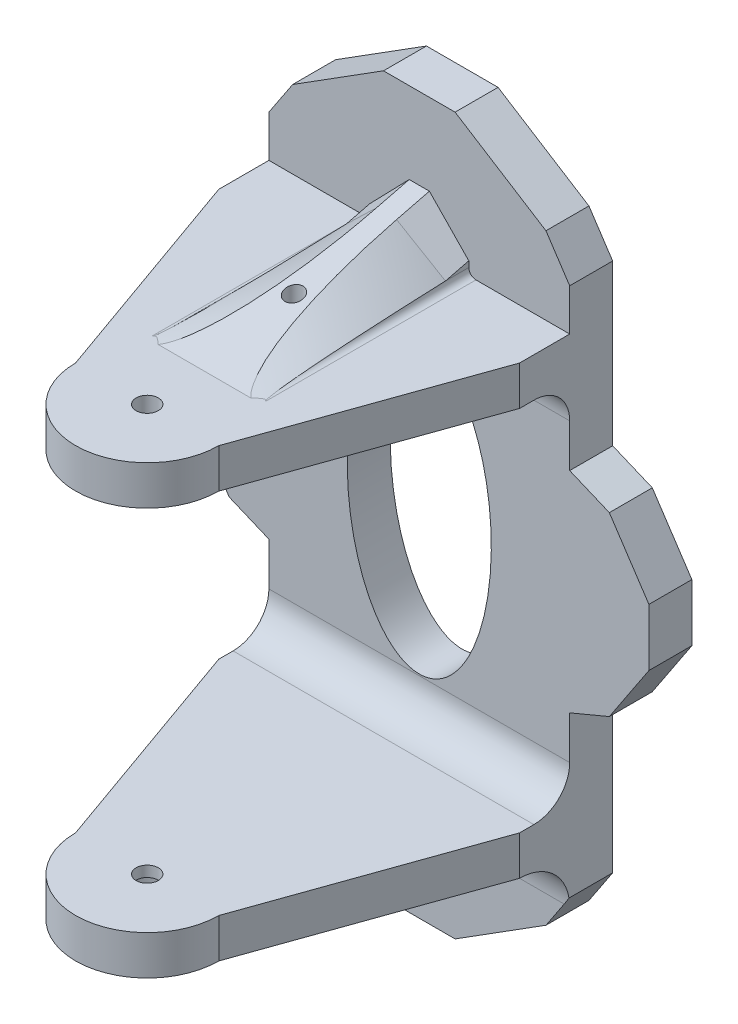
ISO-10303-21;
HEADER;
FILE_DESCRIPTION(('STEP AP214'),'2;1');
FILE_NAME('part.step','',(''),(''),'','','');
FILE_SCHEMA(('AUTOMOTIVE_DESIGN { 1 0 10303 214 1 1 1 1 }'));
ENDSEC;
DATA;
#1=APPLICATION_CONTEXT('core data for automotive mechanical design processes');
#2=APPLICATION_PROTOCOL_DEFINITION('international standard','automotive_design',2000,#1);
#3=PRODUCT_CONTEXT('',#1,'mechanical');
#4=PRODUCT('Part','Part','',(#3));
#5=PRODUCT_RELATED_PRODUCT_CATEGORY('part','',(#4));
#6=PRODUCT_DEFINITION_FORMATION('','',#4);
#7=PRODUCT_DEFINITION_CONTEXT('part definition',#1,'design');
#8=PRODUCT_DEFINITION('design','',#6,#7);
#9=PRODUCT_DEFINITION_SHAPE('','',#8);
#10=(LENGTH_UNIT() NAMED_UNIT(*) SI_UNIT(.MILLI.,.METRE.));
#11=(NAMED_UNIT(*) PLANE_ANGLE_UNIT() SI_UNIT($,.RADIAN.));
#12=(NAMED_UNIT(*) SI_UNIT($,.STERADIAN.) SOLID_ANGLE_UNIT());
#13=UNCERTAINTY_MEASURE_WITH_UNIT(LENGTH_MEASURE(1.E-05),#10,'distance_accuracy_value','');
#14=(GEOMETRIC_REPRESENTATION_CONTEXT(3) GLOBAL_UNCERTAINTY_ASSIGNED_CONTEXT((#13)) GLOBAL_UNIT_ASSIGNED_CONTEXT((#10,
#11,#12)) REPRESENTATION_CONTEXT('',''));
#15=CARTESIAN_POINT('',(0.,0.,0.));
#16=DIRECTION('',(0.,0.,1.));
#17=DIRECTION('',(1.,0.,0.));
#18=AXIS2_PLACEMENT_3D('',#15,#16,#17);
#19=CARTESIAN_POINT('',(11.7629956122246,29.3014124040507,8.36400002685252));
#20=DIRECTION('',(-1.,0.,0.));
#21=DIRECTION('',(0.,-1.,0.));
#22=AXIS2_PLACEMENT_3D('',#19,#20,#21);
#23=PLANE('',#22);
#24=DIRECTION('',(0.,0.,-1.));
#25=VECTOR('',#24,1.);
#26=CARTESIAN_POINT('',(11.7629956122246,35.6490124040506,35.2440000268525));
#27=LINE('',#26,#25);
#28=CARTESIAN_POINT('',(11.7629956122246,35.6490124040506,12.2840000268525));
#29=VERTEX_POINT('',#28);
#30=CARTESIAN_POINT('',(11.7629956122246,35.6490124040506,11.1640000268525));
#31=VERTEX_POINT('',#30);
#32=EDGE_CURVE('E424',#29,#31,#27,.T.);
#33=ORIENTED_EDGE('',*,*,#32,.F.);
#34=DIRECTION('',(0.,-1.,0.));
#35=VECTOR('',#34,1.);
#36=CARTESIAN_POINT('',(11.7629956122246,78.0214124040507,12.2840000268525));
#37=LINE('',#36,#35);
#38=CARTESIAN_POINT('',(11.7629956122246,32.5690124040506,12.2840000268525));
#39=VERTEX_POINT('',#38);
#40=EDGE_CURVE('E1530',#29,#39,#37,.T.);
#41=ORIENTED_EDGE('',*,*,#40,.T.);
#42=CARTESIAN_POINT('',(11.7629956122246,28.6490124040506,12.2840000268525));
#43=DIRECTION('',(-1.,0.,0.));
#44=DIRECTION('',(0.,-1.,0.));
#45=AXIS2_PLACEMENT_3D('',#42,#43,#44);
#46=CIRCLE('',#45,3.92);
#47=CARTESIAN_POINT('',(11.7629956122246,29.3014124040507,8.4186702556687));
#48=VERTEX_POINT('',#47);
#49=EDGE_CURVE('E1459',#39,#48,#46,.T.);
#50=ORIENTED_EDGE('',*,*,#49,.T.);
#51=DIRECTION('',(0.,0.,-1.));
#52=VECTOR('',#51,1.);
#53=CARTESIAN_POINT('',(11.7629956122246,29.3014124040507,8.36400002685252));
#54=LINE('',#53,#52);
#55=CARTESIAN_POINT('',(11.7629956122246,29.3014124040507,5.00400002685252));
#56=VERTEX_POINT('',#55);
#57=EDGE_CURVE('E1412',#48,#56,#54,.T.);
#58=ORIENTED_EDGE('',*,*,#57,.T.);
#59=DIRECTION('',(0.,1.,0.));
#60=VECTOR('',#59,1.);
#61=CARTESIAN_POINT('',(11.7629956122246,29.3014124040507,5.00400002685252));
#62=LINE('',#61,#60);
#63=CARTESIAN_POINT('',(11.7629956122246,41.8173217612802,5.00400002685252));
#64=VERTEX_POINT('',#63);
#65=EDGE_CURVE('E1364',#56,#64,#62,.T.);
#66=ORIENTED_EDGE('',*,*,#65,.T.);
#67=DIRECTION('',(0.,0.,-1.));
#68=VECTOR('',#67,1.);
#69=CARTESIAN_POINT('',(11.7629956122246,41.8173217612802,8.36400002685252));
#70=LINE('',#69,#68);
#71=CARTESIAN_POINT('',(11.7629956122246,41.8173217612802,8.36400002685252));
#72=VERTEX_POINT('',#71);
#73=EDGE_CURVE('E1409',#72,#64,#70,.T.);
#74=ORIENTED_EDGE('',*,*,#73,.F.);
#75=DIRECTION('',(0.,1.,0.));
#76=VECTOR('',#75,1.);
#77=CARTESIAN_POINT('',(11.7629956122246,29.3014124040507,8.36400002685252));
#78=LINE('',#77,#76);
#79=CARTESIAN_POINT('',(11.7629956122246,38.4490124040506,8.36400002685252));
#80=VERTEX_POINT('',#79);
#81=EDGE_CURVE('E1314',#80,#72,#78,.T.);
#82=ORIENTED_EDGE('',*,*,#81,.F.);
#83=CARTESIAN_POINT('',(11.7629956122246,38.4490124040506,11.1640000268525));
#84=DIRECTION('',(-1.,0.,0.));
#85=DIRECTION('',(0.,-1.,0.));
#86=AXIS2_PLACEMENT_3D('',#83,#84,#85);
#87=CIRCLE('',#86,2.8);
#88=EDGE_CURVE('E1248',#80,#31,#87,.T.);
#89=ORIENTED_EDGE('',*,*,#88,.T.);
#90=EDGE_LOOP('',(#33,#41,#50,#58,#66,#74,#82,#89));
#91=FACE_BOUND('',#90,.T.);
#92=ADVANCED_FACE('F61',(#91),#23,.F.);
#93=CARTESIAN_POINT('',(-11.7628309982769,29.3014124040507,8.36400002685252));
#94=DIRECTION('',(1.,0.,0.));
#95=DIRECTION('',(0.,1.,0.));
#96=AXIS2_PLACEMENT_3D('',#93,#94,#95);
#97=PLANE('',#96);
#98=DIRECTION('',(0.,0.,-1.));
#99=VECTOR('',#98,1.);
#100=CARTESIAN_POINT('',(-11.7628309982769,35.6490124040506,35.2440000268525));
#101=LINE('',#100,#99);
#102=CARTESIAN_POINT('',(-11.7628309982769,35.6490124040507,12.2840000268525));
#103=VERTEX_POINT('',#102);
#104=CARTESIAN_POINT('',(-11.7628309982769,35.6490124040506,11.1640000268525));
#105=VERTEX_POINT('',#104);
#106=EDGE_CURVE('E430',#103,#105,#101,.T.);
#107=ORIENTED_EDGE('',*,*,#106,.T.);
#108=CARTESIAN_POINT('',(-11.7628309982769,38.4490124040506,11.1640000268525));
#109=DIRECTION('',(1.,0.,0.));
#110=DIRECTION('',(0.,1.,0.));
#111=AXIS2_PLACEMENT_3D('',#108,#109,#110);
#112=CIRCLE('',#111,2.8);
#113=CARTESIAN_POINT('',(-11.7628309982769,38.4490124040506,8.36400002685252));
#114=VERTEX_POINT('',#113);
#115=EDGE_CURVE('E1251',#105,#114,#112,.T.);
#116=ORIENTED_EDGE('',*,*,#115,.T.);
#117=DIRECTION('',(0.,-1.,0.));
#118=VECTOR('',#117,1.);
#119=CARTESIAN_POINT('',(-11.7628309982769,29.3014124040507,8.36400002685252));
#120=LINE('',#119,#118);
#121=CARTESIAN_POINT('',(-11.7628309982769,41.8173217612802,8.36400002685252));
#122=VERTEX_POINT('',#121);
#123=EDGE_CURVE('E1300',#122,#114,#120,.T.);
#124=ORIENTED_EDGE('',*,*,#123,.F.);
#125=DIRECTION('',(0.,0.,-1.));
#126=VECTOR('',#125,1.);
#127=CARTESIAN_POINT('',(-11.7628309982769,41.8173217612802,8.36400002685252));
#128=LINE('',#127,#126);
#129=CARTESIAN_POINT('',(-11.7628309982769,41.8173217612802,5.00400002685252));
#130=VERTEX_POINT('',#129);
#131=EDGE_CURVE('E1430',#122,#130,#128,.T.);
#132=ORIENTED_EDGE('',*,*,#131,.T.);
#133=DIRECTION('',(0.,-1.,0.));
#134=VECTOR('',#133,1.);
#135=CARTESIAN_POINT('',(-11.7628309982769,29.3014124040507,5.00400002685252));
#136=LINE('',#135,#134);
#137=CARTESIAN_POINT('',(-11.7628309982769,29.3014124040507,5.00400002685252));
#138=VERTEX_POINT('',#137);
#139=EDGE_CURVE('E1352',#130,#138,#136,.T.);
#140=ORIENTED_EDGE('',*,*,#139,.T.);
#141=DIRECTION('',(0.,0.,-1.));
#142=VECTOR('',#141,1.);
#143=CARTESIAN_POINT('',(-11.7628309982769,29.3014124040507,8.36400002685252));
#144=LINE('',#143,#142);
#145=CARTESIAN_POINT('',(-11.7628309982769,29.3014124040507,8.4186702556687));
#146=VERTEX_POINT('',#145);
#147=EDGE_CURVE('E1427',#146,#138,#144,.T.);
#148=ORIENTED_EDGE('',*,*,#147,.F.);
#149=CARTESIAN_POINT('',(-11.7628309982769,28.6490124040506,12.2840000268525));
#150=DIRECTION('',(1.,0.,0.));
#151=DIRECTION('',(0.,1.,0.));
#152=AXIS2_PLACEMENT_3D('',#149,#150,#151);
#153=CIRCLE('',#152,3.92);
#154=CARTESIAN_POINT('',(-11.7628309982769,32.5690124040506,12.2840000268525));
#155=VERTEX_POINT('',#154);
#156=EDGE_CURVE('E840',#146,#155,#153,.T.);
#157=ORIENTED_EDGE('',*,*,#156,.T.);
#158=DIRECTION('',(0.,-1.,0.));
#159=VECTOR('',#158,1.);
#160=CARTESIAN_POINT('',(-11.7628309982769,78.0214124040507,12.2840000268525));
#161=LINE('',#160,#159);
#162=EDGE_CURVE('E1525',#103,#155,#161,.T.);
#163=ORIENTED_EDGE('',*,*,#162,.F.);
#164=EDGE_LOOP('',(#107,#116,#124,#132,#140,#148,#157,#163));
#165=FACE_BOUND('',#164,.T.);
#166=ADVANCED_FACE('F630',(#165),#97,.F.);
#167=CARTESIAN_POINT('',(8.23069738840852E-05,78.0214124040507,29.6440000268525));
#168=DIRECTION('',(0.,-1.,0.));
#169=DIRECTION('',(0.,0.,-1.));
#170=AXIS2_PLACEMENT_3D('',#167,#168,#169);
#171=CYLINDRICAL_SURFACE('',#170,5.6);
#172=DIRECTION('',(0.,-1.,0.));
#173=VECTOR('',#172,1.);
#174=CARTESIAN_POINT('',(5.60008230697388,78.0214124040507,29.6440000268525));
#175=LINE('',#174,#173);
#176=CARTESIAN_POINT('',(5.60008230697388,35.6490124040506,29.6440000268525));
#177=VERTEX_POINT('',#176);
#178=CARTESIAN_POINT('',(5.60008230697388,32.5690124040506,29.6440000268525));
#179=VERTEX_POINT('',#178);
#180=EDGE_CURVE('E1511',#177,#179,#175,.T.);
#181=ORIENTED_EDGE('',*,*,#180,.F.);
#182=CARTESIAN_POINT('',(8.23069738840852E-05,35.6490124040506,29.6440000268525));
#183=DIRECTION('',(0.,1.,0.));
#184=DIRECTION('',(0.,0.,1.));
#185=AXIS2_PLACEMENT_3D('',#182,#183,#184);
#186=CIRCLE('',#185,5.6);
#187=CARTESIAN_POINT('',(-5.59991769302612,35.6490124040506,29.6440000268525));
#188=VERTEX_POINT('',#187);
#189=EDGE_CURVE('E433',#188,#177,#186,.T.);
#190=ORIENTED_EDGE('',*,*,#189,.F.);
#191=DIRECTION('',(0.,-1.,0.));
#192=VECTOR('',#191,1.);
#193=CARTESIAN_POINT('',(-5.59991769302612,78.0214124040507,29.6440000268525));
#194=LINE('',#193,#192);
#195=CARTESIAN_POINT('',(-5.59991769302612,32.5690124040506,29.6440000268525));
#196=VERTEX_POINT('',#195);
#197=EDGE_CURVE('E1514',#188,#196,#194,.T.);
#198=ORIENTED_EDGE('',*,*,#197,.T.);
#199=CARTESIAN_POINT('',(8.23069738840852E-05,32.5690124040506,29.6440000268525));
#200=DIRECTION('',(0.,-1.,0.));
#201=DIRECTION('',(0.,0.,-1.));
#202=AXIS2_PLACEMENT_3D('',#199,#200,#201);
#203=CIRCLE('',#202,5.6);
#204=EDGE_CURVE('E1510',#196,#179,#203,.F.);
#205=ORIENTED_EDGE('',*,*,#204,.T.);
#206=EDGE_LOOP('',(#181,#190,#198,#205));
#207=FACE_BOUND('',#206,.T.);
#208=ADVANCED_FACE('F484',(#207),#171,.T.);
#209=CARTESIAN_POINT('',(-5.59991769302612,78.0214124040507,29.6440000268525));
#210=DIRECTION('',(0.942377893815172,0.,-0.334550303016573));
#211=DIRECTION('',(-0.334550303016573,0.,-0.942377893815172));
#212=AXIS2_PLACEMENT_3D('',#209,#210,#211);
#213=PLANE('',#212);
#214=DIRECTION('',(0.334550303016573,0.,0.942377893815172));
#215=VECTOR('',#214,1.);
#216=CARTESIAN_POINT('',(-5.59991769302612,35.6490124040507,29.6440000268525));
#217=LINE('',#216,#215);
#218=EDGE_CURVE('E435',#103,#188,#217,.T.);
#219=ORIENTED_EDGE('',*,*,#218,.F.);
#220=ORIENTED_EDGE('',*,*,#162,.T.);
#221=DIRECTION('',(0.334550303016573,0.,0.942377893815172));
#222=VECTOR('',#221,1.);
#223=CARTESIAN_POINT('',(-5.59991769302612,32.5690124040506,29.6440000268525));
#224=LINE('',#223,#222);
#225=EDGE_CURVE('E1526',#155,#196,#224,.T.);
#226=ORIENTED_EDGE('',*,*,#225,.T.);
#227=ORIENTED_EDGE('',*,*,#197,.F.);
#228=EDGE_LOOP('',(#219,#220,#226,#227));
#229=FACE_BOUND('',#228,.T.);
#230=ADVANCED_FACE('F479',(#229),#213,.F.);
#231=CARTESIAN_POINT('',(5.60008230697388,78.0214124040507,29.6440000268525));
#232=DIRECTION('',(-0.942377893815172,0.,-0.334550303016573));
#233=DIRECTION('',(-0.334550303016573,0.,0.942377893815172));
#234=AXIS2_PLACEMENT_3D('',#231,#232,#233);
#235=PLANE('',#234);
#236=DIRECTION('',(0.334550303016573,0.,-0.942377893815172));
#237=VECTOR('',#236,1.);
#238=CARTESIAN_POINT('',(5.60008230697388,35.6490124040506,29.6440000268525));
#239=LINE('',#238,#237);
#240=EDGE_CURVE('E1473',#177,#29,#239,.T.);
#241=ORIENTED_EDGE('',*,*,#240,.F.);
#242=ORIENTED_EDGE('',*,*,#180,.T.);
#243=DIRECTION('',(0.334550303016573,0.,-0.942377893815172));
#244=VECTOR('',#243,1.);
#245=CARTESIAN_POINT('',(5.60008230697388,32.5690124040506,29.6440000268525));
#246=LINE('',#245,#244);
#247=EDGE_CURVE('E1532',#179,#39,#246,.T.);
#248=ORIENTED_EDGE('',*,*,#247,.T.);
#249=ORIENTED_EDGE('',*,*,#40,.F.);
#250=EDGE_LOOP('',(#241,#242,#248,#249));
#251=FACE_BOUND('',#250,.T.);
#252=ADVANCED_FACE('F474',(#251),#235,.F.);
#253=CARTESIAN_POINT('',(11.7629956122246,70.7414124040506,8.36400002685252));
#254=DIRECTION('',(-1.,0.,0.));
#255=DIRECTION('',(0.,-1.,0.));
#256=AXIS2_PLACEMENT_3D('',#253,#254,#255);
#257=PLANE('',#256);
#258=DIRECTION('',(0.,0.,-1.));
#259=VECTOR('',#258,1.);
#260=CARTESIAN_POINT('',(11.7629956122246,64.3938124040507,35.2440000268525));
#261=LINE('',#260,#259);
#262=CARTESIAN_POINT('',(11.7629956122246,64.3938124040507,12.2840000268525));
#263=VERTEX_POINT('',#262);
#264=CARTESIAN_POINT('',(11.7629956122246,64.3938124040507,11.1640000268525));
#265=VERTEX_POINT('',#264);
#266=EDGE_CURVE('E440',#263,#265,#261,.T.);
#267=ORIENTED_EDGE('',*,*,#266,.T.);
#268=CARTESIAN_POINT('',(11.7629956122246,61.5938124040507,11.1640000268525));
#269=DIRECTION('',(-1.,0.,0.));
#270=DIRECTION('',(0.,-1.,0.));
#271=AXIS2_PLACEMENT_3D('',#268,#269,#270);
#272=CIRCLE('',#271,2.8);
#273=CARTESIAN_POINT('',(11.7629956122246,61.5938124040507,8.36400002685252));
#274=VERTEX_POINT('',#273);
#275=EDGE_CURVE('E1247',#265,#274,#272,.T.);
#276=ORIENTED_EDGE('',*,*,#275,.T.);
#277=DIRECTION('',(0.,1.,0.));
#278=VECTOR('',#277,1.);
#279=CARTESIAN_POINT('',(11.7629956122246,70.7414124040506,8.36400002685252));
#280=LINE('',#279,#278);
#281=CARTESIAN_POINT('',(11.7629956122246,58.2255030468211,8.36400002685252));
#282=VERTEX_POINT('',#281);
#283=EDGE_CURVE('E1327',#282,#274,#280,.T.);
#284=ORIENTED_EDGE('',*,*,#283,.F.);
#285=DIRECTION('',(0.,0.,-1.));
#286=VECTOR('',#285,1.);
#287=CARTESIAN_POINT('',(11.7629956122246,58.2255030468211,8.36400002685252));
#288=LINE('',#287,#286);
#289=CARTESIAN_POINT('',(11.7629956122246,58.2255030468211,5.00400002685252));
#290=VERTEX_POINT('',#289);
#291=EDGE_CURVE('E1394',#282,#290,#288,.T.);
#292=ORIENTED_EDGE('',*,*,#291,.T.);
#293=DIRECTION('',(0.,1.,0.));
#294=VECTOR('',#293,1.);
#295=CARTESIAN_POINT('',(11.7629956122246,70.7414124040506,5.00400002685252));
#296=LINE('',#295,#294);
#297=CARTESIAN_POINT('',(11.7629956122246,70.7414124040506,5.00400002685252));
#298=VERTEX_POINT('',#297);
#299=EDGE_CURVE('E1376',#290,#298,#296,.T.);
#300=ORIENTED_EDGE('',*,*,#299,.T.);
#301=DIRECTION('',(0.,0.,-1.));
#302=VECTOR('',#301,1.);
#303=CARTESIAN_POINT('',(11.7629956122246,70.7414124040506,8.36400002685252));
#304=LINE('',#303,#302);
#305=CARTESIAN_POINT('',(11.7629956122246,70.7414124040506,8.36400002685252));
#306=VERTEX_POINT('',#305);
#307=EDGE_CURVE('E1391',#306,#298,#304,.T.);
#308=ORIENTED_EDGE('',*,*,#307,.F.);
#309=CARTESIAN_POINT('',(11.7629956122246,67.4738124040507,8.36400002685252));
#310=VERTEX_POINT('',#309);
#311=EDGE_CURVE('E1326',#310,#306,#280,.T.);
#312=ORIENTED_EDGE('',*,*,#311,.F.);
#313=DIRECTION('',(0.,0.,-1.));
#314=VECTOR('',#313,1.);
#315=CARTESIAN_POINT('',(11.7629956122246,67.4738124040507,35.2440000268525));
#316=LINE('',#315,#314);
#317=CARTESIAN_POINT('',(11.7629956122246,67.4738124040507,12.2840000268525));
#318=VERTEX_POINT('',#317);
#319=EDGE_CURVE('E1279',#318,#310,#316,.T.);
#320=ORIENTED_EDGE('',*,*,#319,.F.);
#321=EDGE_CURVE('E1502',#318,#263,#37,.T.);
#322=ORIENTED_EDGE('',*,*,#321,.T.);
#323=EDGE_LOOP('',(#267,#276,#284,#292,#300,#308,#312,#320,#322));
#324=FACE_BOUND('',#323,.T.);
#325=ADVANCED_FACE('F686',(#324),#257,.F.);
#326=CARTESIAN_POINT('',(-11.7628309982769,70.7414124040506,8.36400002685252));
#327=DIRECTION('',(1.,0.,0.));
#328=DIRECTION('',(0.,1.,0.));
#329=AXIS2_PLACEMENT_3D('',#326,#327,#328);
#330=PLANE('',#329);
#331=DIRECTION('',(0.,0.,-1.));
#332=VECTOR('',#331,1.);
#333=CARTESIAN_POINT('',(-11.7628309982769,64.3938124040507,35.2440000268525));
#334=LINE('',#333,#332);
#335=CARTESIAN_POINT('',(-11.7628309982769,64.3938124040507,12.2840000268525));
#336=VERTEX_POINT('',#335);
#337=CARTESIAN_POINT('',(-11.7628309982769,64.3938124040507,11.1640000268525));
#338=VERTEX_POINT('',#337);
#339=EDGE_CURVE('E437',#336,#338,#334,.T.);
#340=ORIENTED_EDGE('',*,*,#339,.F.);
#341=CARTESIAN_POINT('',(-11.7628309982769,67.4738124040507,12.2840000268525));
#342=VERTEX_POINT('',#341);
#343=EDGE_CURVE('E1524',#342,#336,#161,.T.);
#344=ORIENTED_EDGE('',*,*,#343,.F.);
#345=DIRECTION('',(0.,0.,-1.));
#346=VECTOR('',#345,1.);
#347=CARTESIAN_POINT('',(-11.7628309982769,67.4738124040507,35.2440000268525));
#348=LINE('',#347,#346);
#349=CARTESIAN_POINT('',(-11.7628309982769,67.4738124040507,8.36400002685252));
#350=VERTEX_POINT('',#349);
#351=EDGE_CURVE('E1272',#342,#350,#348,.T.);
#352=ORIENTED_EDGE('',*,*,#351,.T.);
#353=DIRECTION('',(0.,-1.,0.));
#354=VECTOR('',#353,1.);
#355=CARTESIAN_POINT('',(-11.7628309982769,70.7414124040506,8.36400002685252));
#356=LINE('',#355,#354);
#357=CARTESIAN_POINT('',(-11.7628309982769,70.7414124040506,8.36400002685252));
#358=VERTEX_POINT('',#357);
#359=EDGE_CURVE('E1266',#358,#350,#356,.T.);
#360=ORIENTED_EDGE('',*,*,#359,.F.);
#361=DIRECTION('',(0.,0.,-1.));
#362=VECTOR('',#361,1.);
#363=CARTESIAN_POINT('',(-11.7628309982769,70.7414124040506,8.36400002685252));
#364=LINE('',#363,#362);
#365=CARTESIAN_POINT('',(-11.7628309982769,70.7414124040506,5.00400002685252));
#366=VERTEX_POINT('',#365);
#367=EDGE_CURVE('E1448',#358,#366,#364,.T.);
#368=ORIENTED_EDGE('',*,*,#367,.T.);
#369=DIRECTION('',(0.,-1.,0.));
#370=VECTOR('',#369,1.);
#371=CARTESIAN_POINT('',(-11.7628309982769,70.7414124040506,5.00400002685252));
#372=LINE('',#371,#370);
#373=CARTESIAN_POINT('',(-11.7628309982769,58.2255030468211,5.00400002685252));
#374=VERTEX_POINT('',#373);
#375=EDGE_CURVE('E1340',#366,#374,#372,.T.);
#376=ORIENTED_EDGE('',*,*,#375,.T.);
#377=DIRECTION('',(0.,0.,-1.));
#378=VECTOR('',#377,1.);
#379=CARTESIAN_POINT('',(-11.7628309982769,58.2255030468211,8.36400002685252));
#380=LINE('',#379,#378);
#381=CARTESIAN_POINT('',(-11.7628309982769,58.2255030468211,8.36400002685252));
#382=VERTEX_POINT('',#381);
#383=EDGE_CURVE('E1445',#382,#374,#380,.T.);
#384=ORIENTED_EDGE('',*,*,#383,.F.);
#385=CARTESIAN_POINT('',(-11.7628309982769,61.5938124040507,8.36400002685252));
#386=VERTEX_POINT('',#385);
#387=EDGE_CURVE('E1288',#386,#382,#356,.T.);
#388=ORIENTED_EDGE('',*,*,#387,.F.);
#389=CARTESIAN_POINT('',(-11.7628309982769,61.5938124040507,11.1640000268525));
#390=DIRECTION('',(1.,0.,0.));
#391=DIRECTION('',(0.,1.,0.));
#392=AXIS2_PLACEMENT_3D('',#389,#390,#391);
#393=CIRCLE('',#392,2.8);
#394=EDGE_CURVE('E1245',#386,#338,#393,.T.);
#395=ORIENTED_EDGE('',*,*,#394,.T.);
#396=EDGE_LOOP('',(#340,#344,#352,#360,#368,#376,#384,#388,#395));
#397=FACE_BOUND('',#396,.T.);
#398=ADVANCED_FACE('F482',(#397),#330,.F.);
#399=CARTESIAN_POINT('',(8.23069738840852E-05,64.3938124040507,29.6440000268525));
#400=DIRECTION('',(0.,-1.,0.));
#401=DIRECTION('',(0.,0.,-1.));
#402=AXIS2_PLACEMENT_3D('',#399,#400,#401);
#403=CIRCLE('',#402,5.6);
#404=CARTESIAN_POINT('',(5.60008230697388,64.3938124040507,29.6440000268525));
#405=VERTEX_POINT('',#404);
#406=CARTESIAN_POINT('',(-5.59991769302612,64.3938124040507,29.6440000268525));
#407=VERTEX_POINT('',#406);
#408=EDGE_CURVE('E443',#405,#407,#403,.T.);
#409=ORIENTED_EDGE('',*,*,#408,.F.);
#410=CARTESIAN_POINT('',(5.60008230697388,67.4738124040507,29.6440000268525));
#411=VERTEX_POINT('',#410);
#412=EDGE_CURVE('E1507',#411,#405,#175,.T.);
#413=ORIENTED_EDGE('',*,*,#412,.F.);
#414=CARTESIAN_POINT('',(8.23069738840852E-05,67.4738124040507,29.6440000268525));
#415=DIRECTION('',(0.,-1.,0.));
#416=DIRECTION('',(0.,0.,-1.));
#417=AXIS2_PLACEMENT_3D('',#414,#415,#416);
#418=CIRCLE('',#417,5.6);
#419=CARTESIAN_POINT('',(-5.59991769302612,67.4738124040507,29.6440000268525));
#420=VERTEX_POINT('',#419);
#421=EDGE_CURVE('E1270',#420,#411,#418,.F.);
#422=ORIENTED_EDGE('',*,*,#421,.F.);
#423=EDGE_CURVE('E1274',#420,#407,#194,.T.);
#424=ORIENTED_EDGE('',*,*,#423,.T.);
#425=EDGE_LOOP('',(#409,#413,#422,#424));
#426=FACE_BOUND('',#425,.T.);
#427=ADVANCED_FACE('F477',(#426),#171,.T.);
#428=DIRECTION('',(-0.334550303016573,0.,-0.942377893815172));
#429=VECTOR('',#428,1.);
#430=CARTESIAN_POINT('',(-5.59991769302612,64.3938124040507,29.6440000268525));
#431=LINE('',#430,#429);
#432=EDGE_CURVE('E445',#407,#336,#431,.T.);
#433=ORIENTED_EDGE('',*,*,#432,.F.);
#434=ORIENTED_EDGE('',*,*,#423,.F.);
#435=DIRECTION('',(0.334550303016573,0.,0.942377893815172));
#436=VECTOR('',#435,1.);
#437=CARTESIAN_POINT('',(-4.52416728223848,67.4738124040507,32.6742271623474));
#438=LINE('',#437,#436);
#439=EDGE_CURVE('E1516',#342,#420,#438,.T.);
#440=ORIENTED_EDGE('',*,*,#439,.F.);
#441=ORIENTED_EDGE('',*,*,#343,.T.);
#442=EDGE_LOOP('',(#433,#434,#440,#441));
#443=FACE_BOUND('',#442,.T.);
#444=ADVANCED_FACE('F472',(#443),#213,.F.);
#445=DIRECTION('',(-0.334550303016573,0.,0.942377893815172));
#446=VECTOR('',#445,1.);
#447=CARTESIAN_POINT('',(5.60008230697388,64.3938124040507,29.6440000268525));
#448=LINE('',#447,#446);
#449=EDGE_CURVE('E839',#263,#405,#448,.T.);
#450=ORIENTED_EDGE('',*,*,#449,.F.);
#451=ORIENTED_EDGE('',*,*,#321,.F.);
#452=DIRECTION('',(0.334550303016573,0.,-0.942377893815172));
#453=VECTOR('',#452,1.);
#454=CARTESIAN_POINT('',(1.8912295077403,67.4738124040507,40.0912806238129));
#455=LINE('',#454,#453);
#456=EDGE_CURVE('E1508',#411,#318,#455,.T.);
#457=ORIENTED_EDGE('',*,*,#456,.F.);
#458=ORIENTED_EDGE('',*,*,#412,.T.);
#459=EDGE_LOOP('',(#450,#451,#457,#458));
#460=FACE_BOUND('',#459,.T.);
#461=ADVANCED_FACE('F468',(#460),#235,.F.);
#462=CARTESIAN_POINT('',(8.23069738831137E-05,22.0214124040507,8.36400002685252));
#463=DIRECTION('',(0.,0.,-1.));
#464=DIRECTION('',(-1.,0.,0.));
#465=AXIS2_PLACEMENT_3D('',#462,#463,#464);
#466=PLANE('',#465);
#467=DIRECTION('',(-1.,0.,0.));
#468=VECTOR('',#467,1.);
#469=CARTESIAN_POINT('',(-11.7628309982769,67.4738124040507,8.36400002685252));
#470=LINE('',#469,#468);
#471=CARTESIAN_POINT('',(-4.43018115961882,67.4738124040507,8.36400002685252));
#472=VERTEX_POINT('',#471);
#473=EDGE_CURVE('E1264',#472,#350,#470,.T.);
#474=ORIENTED_EDGE('',*,*,#473,.F.);
#475=CARTESIAN_POINT('',(-4.43018115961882,68.0338124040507,8.36400002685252));
#476=DIRECTION('',(0.,0.,-1.));
#477=DIRECTION('',(-1.,0.,0.));
#478=AXIS2_PLACEMENT_3D('',#475,#476,#477);
#479=CIRCLE('',#478,0.56);
#480=CARTESIAN_POINT('',(-3.87018115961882,68.0338124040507,8.36400002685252));
#481=VERTEX_POINT('',#480);
#482=EDGE_CURVE('E735',#472,#481,#479,.F.);
#483=ORIENTED_EDGE('',*,*,#482,.T.);
#484=DIRECTION('',(0.,-1.,0.));
#485=VECTOR('',#484,1.);
#486=CARTESIAN_POINT('',(-3.87018115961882,73.0738124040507,8.36400002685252));
#487=LINE('',#486,#485);
#488=CARTESIAN_POINT('',(-3.87018115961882,68.4882328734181,8.36400002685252));
#489=VERTEX_POINT('',#488);
#490=EDGE_CURVE('E534',#489,#481,#487,.T.);
#491=ORIENTED_EDGE('',*,*,#490,.F.);
#492=DIRECTION('',(0.696367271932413,0.717685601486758,0.));
#493=VECTOR('',#492,1.);
#494=CARTESIAN_POINT('',(-25.2162357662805,46.4886980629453,8.36400002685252));
#495=LINE('',#494,#493);
#496=CARTESIAN_POINT('',(-0.790181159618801,71.6625228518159,8.36400002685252));
#497=VERTEX_POINT('',#496);
#498=EDGE_CURVE('E525',#489,#497,#495,.T.);
#499=ORIENTED_EDGE('',*,*,#498,.T.);
#500=DIRECTION('',(1.,0.,0.));
#501=VECTOR('',#500,1.);
#502=CARTESIAN_POINT('',(8.23069738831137E-05,71.6625228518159,8.36400002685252));
#503=LINE('',#502,#501);
#504=CARTESIAN_POINT('',(0.790345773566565,71.6625228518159,8.36400002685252));
#505=VERTEX_POINT('',#504);
#506=EDGE_CURVE('E838',#497,#505,#503,.T.);
#507=ORIENTED_EDGE('',*,*,#506,.T.);
#508=DIRECTION('',(0.696367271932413,-0.717685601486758,0.));
#509=VECTOR('',#508,1.);
#510=CARTESIAN_POINT('',(25.2164003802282,46.4886980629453,8.36400002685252));
#511=LINE('',#510,#509);
#512=CARTESIAN_POINT('',(3.87034577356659,68.4882328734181,8.36400002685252));
#513=VERTEX_POINT('',#512);
#514=EDGE_CURVE('E12',#505,#513,#511,.T.);
#515=ORIENTED_EDGE('',*,*,#514,.T.);
#516=DIRECTION('',(0.,-1.,0.));
#517=VECTOR('',#516,1.);
#518=CARTESIAN_POINT('',(3.87034577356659,73.0738124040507,8.36400002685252));
#519=LINE('',#518,#517);
#520=CARTESIAN_POINT('',(3.87034577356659,68.0338124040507,8.36400002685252));
#521=VERTEX_POINT('',#520);
#522=EDGE_CURVE('E1535',#513,#521,#519,.T.);
#523=ORIENTED_EDGE('',*,*,#522,.T.);
#524=CARTESIAN_POINT('',(4.43034577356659,68.0338124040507,8.36400002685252));
#525=DIRECTION('',(0.,0.,-1.));
#526=DIRECTION('',(-1.,0.,0.));
#527=AXIS2_PLACEMENT_3D('',#524,#525,#526);
#528=CIRCLE('',#527,0.56);
#529=CARTESIAN_POINT('',(4.43034577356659,67.4738124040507,8.36400002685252));
#530=VERTEX_POINT('',#529);
#531=EDGE_CURVE('E726',#521,#530,#528,.F.);
#532=ORIENTED_EDGE('',*,*,#531,.T.);
#533=EDGE_CURVE('E1269',#310,#530,#470,.T.);
#534=ORIENTED_EDGE('',*,*,#533,.F.);
#535=ORIENTED_EDGE('',*,*,#311,.T.);
#536=DIRECTION('',(-0.552770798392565,0.833333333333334,0.));
#537=VECTOR('',#536,1.);
#538=CARTESIAN_POINT('',(9.90568572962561,73.5414124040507,8.36400002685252));
#539=LINE('',#538,#537);
#540=CARTESIAN_POINT('',(9.90568572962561,73.5414124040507,8.36400002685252));
#541=VERTEX_POINT('',#540);
#542=EDGE_CURVE('E1329',#306,#541,#539,.T.);
#543=ORIENTED_EDGE('',*,*,#542,.T.);
#544=DIRECTION('',(-0.845905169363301,0.533333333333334,0.));
#545=VECTOR('',#544,1.);
#546=CARTESIAN_POINT('',(2.80008230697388,78.0214124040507,8.36400002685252));
#547=LINE('',#546,#545);
#548=CARTESIAN_POINT('',(2.80008230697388,78.0214124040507,8.36400002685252));
#549=VERTEX_POINT('',#548);
#550=EDGE_CURVE('E1331',#541,#549,#547,.T.);
#551=ORIENTED_EDGE('',*,*,#550,.T.);
#552=DIRECTION('',(-1.,0.,0.));
#553=VECTOR('',#552,1.);
#554=CARTESIAN_POINT('',(2.80008230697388,78.0214124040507,8.36400002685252));
#555=LINE('',#554,#553);
#556=CARTESIAN_POINT('',(-2.79991769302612,78.0214124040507,8.36400002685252));
#557=VERTEX_POINT('',#556);
#558=EDGE_CURVE('E1333',#549,#557,#555,.T.);
#559=ORIENTED_EDGE('',*,*,#558,.T.);
#560=DIRECTION('',(-0.845905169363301,-0.533333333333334,0.));
#561=VECTOR('',#560,1.);
#562=CARTESIAN_POINT('',(-2.79991769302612,78.0214124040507,8.36400002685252));
#563=LINE('',#562,#561);
#564=CARTESIAN_POINT('',(-9.90552111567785,73.5414124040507,8.36400002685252));
#565=VERTEX_POINT('',#564);
#566=EDGE_CURVE('E1282',#557,#565,#563,.T.);
#567=ORIENTED_EDGE('',*,*,#566,.T.);
#568=DIRECTION('',(-0.552770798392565,-0.833333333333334,0.));
#569=VECTOR('',#568,1.);
#570=CARTESIAN_POINT('',(-9.90552111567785,73.5414124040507,8.36400002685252));
#571=LINE('',#570,#569);
#572=EDGE_CURVE('E1285',#565,#358,#571,.T.);
#573=ORIENTED_EDGE('',*,*,#572,.T.);
#574=ORIENTED_EDGE('',*,*,#359,.T.);
#575=EDGE_LOOP('',(#474,#483,#491,#499,#507,#515,#523,#532,#534,#535,#543,#551,#559,#567,#573,#574));
#576=FACE_BOUND('',#575,.T.);
#577=ADVANCED_FACE('F471',(#576),#466,.F.);
#578=CARTESIAN_POINT('',(-11.7628309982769,67.4738124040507,35.2440000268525));
#579=DIRECTION('',(0.,-1.,0.));
#580=DIRECTION('',(0.,0.,-1.));
#581=AXIS2_PLACEMENT_3D('',#578,#579,#580);
#582=PLANE('',#581);
#583=CARTESIAN_POINT('',(8.23069738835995E-05,67.4738124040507,29.6440000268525));
#584=DIRECTION('',(0.,-1.,0.));
#585=DIRECTION('',(0.,0.,-1.));
#586=AXIS2_PLACEMENT_3D('',#583,#584,#585);
#587=CIRCLE('',#586,0.868000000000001);
#588=CARTESIAN_POINT('',(8.23069738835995E-05,67.4738124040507,28.7760000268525));
#589=VERTEX_POINT('',#588);
#590=EDGE_CURVE('E412',#589,#589,#587,.T.);
#591=ORIENTED_EDGE('',*,*,#590,.T.);
#592=EDGE_LOOP('',(#591));
#593=FACE_BOUND('',#592,.T.);
#594=DIRECTION('',(1.,0.,0.));
#595=VECTOR('',#594,1.);
#596=CARTESIAN_POINT('',(3.87034577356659,67.4738124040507,25.1640000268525));
#597=LINE('',#596,#595);
#598=CARTESIAN_POINT('',(-3.61926609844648,67.4738124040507,25.1640015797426));
#599=VERTEX_POINT('',#598);
#600=CARTESIAN_POINT('',(3.61941239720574,67.473816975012,25.1639816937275));
#601=VERTEX_POINT('',#600);
#602=EDGE_CURVE('E517',#599,#601,#597,.T.);
#603=ORIENTED_EDGE('',*,*,#602,.F.);
#604=CARTESIAN_POINT('',(-4.43018118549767,67.4738124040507,24.7858053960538));
#605=CARTESIAN_POINT('',(-4.42964178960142,67.4738124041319,24.7858050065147));
#606=CARTESIAN_POINT('',(-4.42910244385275,67.4738124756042,24.7857899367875));
#607=CARTESIAN_POINT('',(-4.42802685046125,67.4738127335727,24.7857312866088));
#608=CARTESIAN_POINT('',(-4.4274905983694,67.4738129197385,24.7856877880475));
#609=CARTESIAN_POINT('',(-4.42642081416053,67.4738133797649,24.7855730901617));
#610=CARTESIAN_POINT('',(-4.42588728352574,67.4738136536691,24.785501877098));
#611=CARTESIAN_POINT('',(-4.42482252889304,67.4738142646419,24.785332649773));
#612=CARTESIAN_POINT('',(-4.42429132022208,67.4738146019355,24.7852345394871));
#613=CARTESIAN_POINT('',(-4.42323080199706,67.4738153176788,24.7850123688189));
#614=CARTESIAN_POINT('',(-4.4227015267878,67.47381569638,24.7848881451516));
#615=CARTESIAN_POINT('',(-4.4216444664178,67.4738164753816,24.7846145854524));
#616=CARTESIAN_POINT('',(-4.42111673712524,67.4738168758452,24.7844650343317));
#617=CARTESIAN_POINT('',(-4.4200623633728,67.473817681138,24.7841416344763));
#618=CARTESIAN_POINT('',(-4.41953579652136,67.4738180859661,24.7839675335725));
#619=CARTESIAN_POINT('',(-4.4184833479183,67.4738188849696,24.7835958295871));
#620=CARTESIAN_POINT('',(-4.41795756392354,67.4738192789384,24.783397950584));
#621=CARTESIAN_POINT('',(-4.41690628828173,67.4738200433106,24.7829794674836));
#622=CARTESIAN_POINT('',(-4.41638091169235,67.4738204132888,24.7827585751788));
#623=CARTESIAN_POINT('',(-4.4153300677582,67.4738211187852,24.7822948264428));
#624=CARTESIAN_POINT('',(-4.41480472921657,67.4738214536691,24.7820516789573));
#625=CARTESIAN_POINT('',(-4.41375358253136,67.4738220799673,24.7815441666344));
#626=CARTESIAN_POINT('',(-4.41322791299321,67.4738223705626,24.7812795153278));
#627=CARTESIAN_POINT('',(-4.41217575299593,67.4738229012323,24.7807297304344));
#628=CARTESIAN_POINT('',(-4.41164940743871,67.4738231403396,24.7804443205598));
#629=CARTESIAN_POINT('',(-4.41005426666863,67.4738237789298,24.7795504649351));
#630=CARTESIAN_POINT('',(-4.40899852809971,67.4738240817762,24.7789186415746));
#631=CARTESIAN_POINT('',(-4.406879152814,67.4738244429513,24.7775827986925));
#632=CARTESIAN_POINT('',(-4.40581666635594,67.4738244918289,24.7768769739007));
#633=CARTESIAN_POINT('',(-4.40368105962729,67.4738243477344,24.7753985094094));
#634=CARTESIAN_POINT('',(-4.40260898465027,67.473824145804,24.774624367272));
#635=CARTESIAN_POINT('',(-4.40045179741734,67.4738235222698,24.7730145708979));
#636=CARTESIAN_POINT('',(-4.39936759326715,67.4738230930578,24.7721777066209));
#637=CARTESIAN_POINT('',(-4.39603703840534,67.4738215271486,24.769539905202));
#638=CARTESIAN_POINT('',(-4.39382712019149,67.4738201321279,24.7676931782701));
#639=CARTESIAN_POINT('',(-4.38932514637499,67.4738171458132,24.7638209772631));
#640=CARTESIAN_POINT('',(-4.38703656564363,67.473815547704,24.7617915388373));
#641=CARTESIAN_POINT('',(-4.38236406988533,67.473813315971,24.7575901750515));
#642=CARTESIAN_POINT('',(-4.37998174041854,67.4738127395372,24.7554165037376));
#643=CARTESIAN_POINT('',(-4.3738080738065,67.4738118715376,24.7498028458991));
#644=CARTESIAN_POINT('',(-4.37001092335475,67.4738119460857,24.7463688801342));
#645=CARTESIAN_POINT('',(-4.36416983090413,67.4738115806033,24.7412975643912));
#646=CARTESIAN_POINT('',(-4.36217632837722,67.473811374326,24.7396026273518));
#647=CARTESIAN_POINT('',(-4.35812638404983,67.4738110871,24.7362507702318));
#648=CARTESIAN_POINT('',(-4.3560695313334,67.4738110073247,24.7345943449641));
#649=CARTESIAN_POINT('',(-4.35188876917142,67.4738109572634,24.7313417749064));
#650=CARTESIAN_POINT('',(-4.3497645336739,67.4738109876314,24.7297460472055));
#651=CARTESIAN_POINT('',(-4.34544610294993,67.4738111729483,24.7266356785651));
#652=CARTESIAN_POINT('',(-4.34325169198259,67.4738113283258,24.7251213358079));
#653=CARTESIAN_POINT('',(-4.33879045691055,67.4738116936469,24.7221939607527));
#654=CARTESIAN_POINT('',(-4.33652351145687,67.4738119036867,24.7207811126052));
#655=CARTESIAN_POINT('',(-4.33191551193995,67.4738122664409,24.718075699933));
#656=CARTESIAN_POINT('',(-4.32957438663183,67.4738124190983,24.7167832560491));
#657=CARTESIAN_POINT('',(-4.32501666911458,67.4738123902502,24.7144405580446));
#658=CARTESIAN_POINT('',(-4.3228058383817,67.4738122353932,24.7133791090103));
#659=CARTESIAN_POINT('',(-4.31829820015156,67.4738117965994,24.711370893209));
#660=CARTESIAN_POINT('',(-4.31600065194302,67.4738115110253,24.710425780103));
#661=CARTESIAN_POINT('',(-4.31250278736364,67.4738111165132,24.7091064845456));
#662=CARTESIAN_POINT('',(-4.31132157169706,67.4738109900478,24.70868104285));
#663=CARTESIAN_POINT('',(-4.30893696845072,67.4738107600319,24.7078625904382));
#664=CARTESIAN_POINT('',(-4.30773347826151,67.47381065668,24.7074698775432));
#665=CARTESIAN_POINT('',(-4.30530420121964,67.4738104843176,24.7067180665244));
#666=CARTESIAN_POINT('',(-4.30407831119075,67.473810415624,24.7063593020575));
#667=CARTESIAN_POINT('',(-4.30160407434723,67.473810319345,24.7056765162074));
#668=CARTESIAN_POINT('',(-4.30035562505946,67.4738102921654,24.7053528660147));
#669=CARTESIAN_POINT('',(-4.29783614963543,67.4738102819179,24.7047414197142));
#670=CARTESIAN_POINT('',(-4.29656502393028,67.4738102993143,24.7044540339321));
#671=CARTESIAN_POINT('',(-4.29400009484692,67.4738103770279,24.7039162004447));
#672=CARTESIAN_POINT('',(-4.2927061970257,67.4738104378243,24.7036662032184));
#673=CARTESIAN_POINT('',(-4.29009564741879,67.4738105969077,24.7032042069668));
#674=CARTESIAN_POINT('',(-4.28877890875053,67.4738106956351,24.7029926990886));
#675=CARTESIAN_POINT('',(-4.28612262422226,67.4738109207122,24.7026087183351));
#676=CARTESIAN_POINT('',(-4.28478300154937,67.4738110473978,24.7024367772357));
#677=CARTESIAN_POINT('',(-4.28208091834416,67.4738113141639,24.702132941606));
#678=CARTESIAN_POINT('',(-4.28071839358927,67.4738114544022,24.7020016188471));
#679=CARTESIAN_POINT('',(-4.27797050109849,67.4738117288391,24.7017800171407));
#680=CARTESIAN_POINT('',(-4.2765850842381,67.4738118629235,24.7016903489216));
#681=CARTESIAN_POINT('',(-4.27379141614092,67.4738121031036,24.7015530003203));
#682=CARTESIAN_POINT('',(-4.27238313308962,67.4738122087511,24.7015059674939));
#683=CARTESIAN_POINT('',(-4.26954380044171,67.4738123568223,24.7014549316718));
#684=CARTESIAN_POINT('',(-4.26811273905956,67.4738123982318,24.7014516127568));
#685=CARTESIAN_POINT('',(-4.26438806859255,67.4738124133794,24.7014993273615));
#686=CARTESIAN_POINT('',(-4.26209484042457,67.4738123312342,24.7015843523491));
#687=CARTESIAN_POINT('',(-4.25743271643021,67.4738121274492,24.7018614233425));
#688=CARTESIAN_POINT('',(-4.25506404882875,67.4738120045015,24.7020571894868));
#689=CARTESIAN_POINT('',(-4.25025022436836,67.4738117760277,24.7025584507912));
#690=CARTESIAN_POINT('',(-4.24780546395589,67.4738116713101,24.7028677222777));
#691=CARTESIAN_POINT('',(-4.24283891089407,67.4738115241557,24.7035984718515));
#692=CARTESIAN_POINT('',(-4.24031767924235,67.4738114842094,24.7040237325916));
#693=CARTESIAN_POINT('',(-4.23519776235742,67.473811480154,24.7049889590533));
#694=CARTESIAN_POINT('',(-4.23259978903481,67.4738115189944,24.7055326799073));
#695=CARTESIAN_POINT('',(-4.22732613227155,67.4738116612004,24.7067372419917));
#696=CARTESIAN_POINT('',(-4.22465129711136,67.4738117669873,24.7074017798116));
#697=CARTESIAN_POINT('',(-4.2192238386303,67.4738119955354,24.7088504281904));
#698=CARTESIAN_POINT('',(-4.21647218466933,67.4738121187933,24.709638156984));
#699=CARTESIAN_POINT('',(-4.21089109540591,67.4738123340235,24.7113352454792));
#700=CARTESIAN_POINT('',(-4.20806273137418,67.4738124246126,24.7122481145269));
#701=CARTESIAN_POINT('',(-4.20127865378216,67.4738123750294,24.7145560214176));
#702=CARTESIAN_POINT('',(-4.1973378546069,67.4738121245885,24.7159949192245));
#703=CARTESIAN_POINT('',(-4.18926320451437,67.473811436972,24.7191167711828));
#704=CARTESIAN_POINT('',(-4.1851331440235,67.4738109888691,24.7208094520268));
#705=CARTESIAN_POINT('',(-4.17667813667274,67.473810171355,24.7244429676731));
#706=CARTESIAN_POINT('',(-4.17235702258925,67.4738098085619,24.7263926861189));
#707=CARTESIAN_POINT('',(-4.16351920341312,67.4738092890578,24.7305448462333));
#708=CARTESIAN_POINT('',(-4.15900634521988,67.4738091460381,24.7327554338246));
#709=CARTESIAN_POINT('',(-4.14477887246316,67.4738091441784,24.7399707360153));
#710=CARTESIAN_POINT('',(-4.13518159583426,67.4738098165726,24.7452070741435));
#711=CARTESIAN_POINT('',(-4.11519183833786,67.4738113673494,24.7567080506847));
#712=CARTESIAN_POINT('',(-4.10482833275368,67.4738122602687,24.763022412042));
#713=CARTESIAN_POINT('',(-4.08686369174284,67.4738125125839,24.7744487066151));
#714=CARTESIAN_POINT('',(-4.07920820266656,67.4738121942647,24.7794759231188));
#715=CARTESIAN_POINT('',(-4.06339867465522,67.4738117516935,24.7901174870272));
#716=CARTESIAN_POINT('',(-4.05525446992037,67.4738116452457,24.7957464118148));
#717=CARTESIAN_POINT('',(-4.03846806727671,67.4738116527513,24.8075992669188));
#718=CARTESIAN_POINT('',(-4.02983490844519,67.4738117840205,24.8138359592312));
#719=CARTESIAN_POINT('',(-4.01207136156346,67.4738121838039,24.8269099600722));
#720=CARTESIAN_POINT('',(-4.00294922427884,67.4738124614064,24.8337584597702));
#721=CARTESIAN_POINT('',(-3.98706352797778,67.4738123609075,24.845886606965));
#722=CARTESIAN_POINT('',(-3.98027564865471,67.4738121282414,24.8511344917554));
#723=CARTESIAN_POINT('',(-3.96636855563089,67.4738114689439,24.8620025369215));
#724=CARTESIAN_POINT('',(-3.95925257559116,67.4738110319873,24.8676268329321));
#725=CARTESIAN_POINT('',(-3.94468821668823,67.4738102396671,24.8792488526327));
#726=CARTESIAN_POINT('',(-3.93724278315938,67.4738098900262,24.8852502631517));
#727=CARTESIAN_POINT('',(-3.92201915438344,67.4738093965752,24.8976280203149));
#728=CARTESIAN_POINT('',(-3.91424367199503,67.4738092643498,24.9040077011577));
#729=CARTESIAN_POINT('',(-3.89835987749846,67.4738092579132,24.9171432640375));
#730=CARTESIAN_POINT('',(-3.89025407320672,67.4738093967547,24.9239021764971));
#731=CARTESIAN_POINT('',(-3.87370999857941,67.4738098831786,24.9377974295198));
#732=CARTESIAN_POINT('',(-3.86527406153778,67.4738102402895,24.9449365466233));
#733=CARTESIAN_POINT('',(-3.84807042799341,67.4738110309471,24.9595932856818));
#734=CARTESIAN_POINT('',(-3.83930491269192,67.4738114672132,24.9671134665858));
#735=CARTESIAN_POINT('',(-3.82144341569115,67.4738121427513,24.9825335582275));
#736=CARTESIAN_POINT('',(-3.81234949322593,67.4738123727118,24.9904358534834));
#737=CARTESIAN_POINT('',(-3.79641190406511,67.4738124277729,25.0043656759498));
#738=CARTESIAN_POINT('',(-3.7895584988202,67.4738123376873,25.0103820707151));
#739=CARTESIAN_POINT('',(-3.77561888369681,67.4738121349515,25.0226663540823));
#740=CARTESIAN_POINT('',(-3.76853354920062,67.4738120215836,25.0289352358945));
#741=CARTESIAN_POINT('',(-3.75412995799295,67.4738118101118,25.041724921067));
#742=CARTESIAN_POINT('',(-3.74681252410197,67.4738117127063,25.0482466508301));
#743=CARTESIAN_POINT('',(-3.731944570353,67.4738115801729,25.0615422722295));
#744=CARTESIAN_POINT('',(-3.72439482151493,67.4738115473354,25.0683170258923));
#745=CARTESIAN_POINT('',(-3.70906222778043,67.4738115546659,25.0821189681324));
#746=CARTESIAN_POINT('',(-3.70128010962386,67.4738115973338,25.0891469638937));
#747=CARTESIAN_POINT('',(-3.68548287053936,67.4738117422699,25.1034556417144));
#748=CARTESIAN_POINT('',(-3.67746843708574,67.4738118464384,25.1107370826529));
#749=CARTESIAN_POINT('',(-3.66120675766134,67.4738120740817,25.1255528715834));
#750=CARTESIAN_POINT('',(-3.65296016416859,67.4738121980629,25.133087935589));
#751=CARTESIAN_POINT('',(-3.63623453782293,67.4738123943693,25.1484112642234));
#752=CARTESIAN_POINT('',(-3.62775612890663,67.4738124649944,25.1562002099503));
#753=CARTESIAN_POINT('',(-3.61928750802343,67.4738124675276,25.1639997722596));
#754=B_SPLINE_CURVE_WITH_KNOTS('',3,(#604,#605,#606,#607,#608,#609,#610,#611,#612,#613,#614,
#615,#616,#617,#618,#619,#620,#621,#622,#623,#624,#625,#626,#627,#628,#629,#630,#631,#632,#633,
#634,#635,#636,#637,#638,#639,#640,#641,#642,#643,#644,#645,#646,#647,#648,#649,#650,#651,#652,
#653,#654,#655,#656,#657,#658,#659,#660,#661,#662,#663,#664,#665,#666,#667,#668,#669,#670,#671,
#672,#673,#674,#675,#676,#677,#678,#679,#680,#681,#682,#683,#684,#685,#686,#687,#688,#689,#690,
#691,#692,#693,#694,#695,#696,#697,#698,#699,#700,#701,#702,#703,#704,#705,#706,#707,#708,#709,
#710,#711,#712,#713,#714,#715,#716,#717,#718,#719,#720,#721,#722,#723,#724,#725,#726,#727,#728,
#729,#730,#731,#732,#733,#734,#735,#736,#737,#738,#739,#740,#741,#742,#743,#744,#745,#746,#747,
#748,#749,#750,#751,#752,#753),.UNSPECIFIED.,.F.,.F.,(4,2,2,2,2,2,2,2,2,2,2,2,2,2,2,2,2,2,2,2,2,
2,2,2,2,2,2,2,2,2,2,2,2,2,2,2,2,2,2,2,2,2,2,2,2,2,2,2,2,2,2,2,2,2,2,2,2,2,2,2,2,2,2,2,2,2,2,2,2,
2,2,2,2,2,4),(0.,0.00161793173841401,0.00323122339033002,0.00484531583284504,
0.00646524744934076,0.00809562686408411,0.00974061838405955,0.0114039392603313,
0.0130888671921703,0.0147982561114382,0.0165345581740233,0.0182998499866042,0.0200958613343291,
0.0237850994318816,0.0276106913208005,0.0315769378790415,0.0356852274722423,0.0443223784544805,
0.0534982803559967,0.0631732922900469,0.0785303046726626,0.0863794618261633,0.0943010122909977,
0.102269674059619,0.110265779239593,0.11827604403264,0.126294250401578,0.133647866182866,
0.14109622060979,0.144862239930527,0.148659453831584,0.152490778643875,0.156359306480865,
0.160268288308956,0.16422111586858,0.168221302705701,0.17227246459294,0.176378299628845,
0.180542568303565,0.184769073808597,0.189061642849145,0.195943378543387,0.203071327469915,
0.210461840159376,0.21813031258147,0.22609115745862,0.234357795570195,0.242942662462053,
0.251857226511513,0.264439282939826,0.277826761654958,0.292045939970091,0.307119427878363,
0.339901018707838,0.376296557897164,0.403769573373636,0.433467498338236,0.465416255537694,
0.499634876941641,0.525374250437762,0.552584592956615,0.581273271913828,0.611446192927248,
0.64310789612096,0.676261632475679,0.71090942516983,0.74705211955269,0.774410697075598,
0.802792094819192,0.832197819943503,0.862629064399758,0.894086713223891,0.926571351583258,
0.960083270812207,0.994622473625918),.UNSPECIFIED.);
#755=CARTESIAN_POINT('',(-4.43018115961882,67.4738124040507,24.7857971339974));
#756=VERTEX_POINT('',#755);
#757=EDGE_CURVE('E816',#599,#756,#754,.F.);
#758=ORIENTED_EDGE('',*,*,#757,.T.);
#759=DIRECTION('',(0.,0.,1.));
#760=VECTOR('',#759,1.);
#761=CARTESIAN_POINT('',(-4.43018115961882,67.4738124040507,8.36400002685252));
#762=LINE('',#761,#760);
#763=EDGE_CURVE('E723',#756,#472,#762,.F.);
#764=ORIENTED_EDGE('',*,*,#763,.T.);
#765=ORIENTED_EDGE('',*,*,#473,.T.);
#766=ORIENTED_EDGE('',*,*,#351,.F.);
#767=ORIENTED_EDGE('',*,*,#439,.T.);
#768=ORIENTED_EDGE('',*,*,#421,.T.);
#769=ORIENTED_EDGE('',*,*,#456,.T.);
#770=ORIENTED_EDGE('',*,*,#319,.T.);
#771=ORIENTED_EDGE('',*,*,#533,.T.);
#772=DIRECTION('',(0.,0.,-1.));
#773=VECTOR('',#772,1.);
#774=CARTESIAN_POINT('',(4.43034577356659,67.4738124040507,25.1640000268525));
#775=LINE('',#774,#773);
#776=CARTESIAN_POINT('',(4.43034578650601,67.4738124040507,24.7858012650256));
#777=VERTEX_POINT('',#776);
#778=EDGE_CURVE('E520',#530,#777,#775,.F.);
#779=ORIENTED_EDGE('',*,*,#778,.T.);
#780=CARTESIAN_POINT('',(3.6194521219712,67.4738124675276,25.1639997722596));
#781=CARTESIAN_POINT('',(3.62794745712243,67.4738124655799,25.1561756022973));
#782=CARTESIAN_POINT('',(3.63645264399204,67.4738123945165,25.1483621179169));
#783=CARTESIAN_POINT('',(3.6532304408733,67.4738121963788,25.1329912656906));
#784=CARTESIAN_POINT('',(3.66150242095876,67.4738120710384,25.1254332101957));
#785=CARTESIAN_POINT('',(3.67781348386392,67.4738118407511,25.1105729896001));
#786=CARTESIAN_POINT('',(3.6858519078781,67.4738117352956,25.1032701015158));
#787=CARTESIAN_POINT('',(3.7016957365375,67.4738115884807,25.088920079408));
#788=CARTESIAN_POINT('',(3.70950044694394,67.4738115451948,25.0818721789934));
#789=CARTESIAN_POINT('',(3.72487683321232,67.473811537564,25.0680319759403));
#790=CARTESIAN_POINT('',(3.73244777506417,67.4738115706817,25.0612388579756));
#791=CARTESIAN_POINT('',(3.74735672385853,67.4738117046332,25.0479080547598));
#792=CARTESIAN_POINT('',(3.75469395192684,67.4738118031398,25.0413694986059));
#793=CARTESIAN_POINT('',(3.76913574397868,67.4738120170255,25.0285477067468));
#794=CARTESIAN_POINT('',(3.77623947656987,67.4738121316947,25.0222635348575));
#795=CARTESIAN_POINT('',(3.7902145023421,67.4738123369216,25.0099502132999));
#796=CARTESIAN_POINT('',(3.79708491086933,67.4738124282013,25.0039200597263));
#797=CARTESIAN_POINT('',(3.81306833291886,67.4738123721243,24.9899532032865));
#798=CARTESIAN_POINT('',(3.82219118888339,67.4738121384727,24.9820277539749));
#799=CARTESIAN_POINT('',(3.84010839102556,67.4738114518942,24.9665640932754));
#800=CARTESIAN_POINT('',(3.84890065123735,67.4738110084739,24.9590234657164));
#801=CARTESIAN_POINT('',(3.86615559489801,67.4738102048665,24.9443285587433));
#802=CARTESIAN_POINT('',(3.87461606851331,67.4738098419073,24.9371716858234));
#803=CARTESIAN_POINT('',(3.89120702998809,67.4738093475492,24.9232436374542));
#804=CARTESIAN_POINT('',(3.89933515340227,67.4738092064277,24.9164696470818));
#805=CARTESIAN_POINT('',(3.91526139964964,67.4738092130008,24.9033066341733));
#806=CARTESIAN_POINT('',(3.92305698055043,67.4738093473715,24.8969145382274));
#807=CARTESIAN_POINT('',(3.93831862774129,67.4738098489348,24.8845146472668));
#808=CARTESIAN_POINT('',(3.9457819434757,67.4738102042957,24.8785034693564));
#809=CARTESIAN_POINT('',(3.96037990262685,67.4738110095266,24.8668645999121));
#810=CARTESIAN_POINT('',(3.96751155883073,67.4738114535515,24.8612331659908));
#811=CARTESIAN_POINT('',(3.98144786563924,67.4738121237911,24.8503535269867));
#812=CARTESIAN_POINT('',(3.98824923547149,67.4738123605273,24.8451011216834));
#813=CARTESIAN_POINT('',(4.00420172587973,67.4738124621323,24.8329371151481));
#814=CARTESIAN_POINT('',(4.01337784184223,67.4738121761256,24.8260581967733));
#815=CARTESIAN_POINT('',(4.03124296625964,67.4738117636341,24.8129326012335));
#816=CARTESIAN_POINT('',(4.03992350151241,67.4738116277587,24.8066744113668));
#817=CARTESIAN_POINT('',(4.05679829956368,67.4738116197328,24.7947877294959));
#818=CARTESIAN_POINT('',(4.06498327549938,67.4738117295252,24.7891460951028));
#819=CARTESIAN_POINT('',(4.08086801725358,67.4738121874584,24.7784881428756));
#820=CARTESIAN_POINT('',(4.0885576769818,67.4738125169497,24.7734567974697));
#821=CARTESIAN_POINT('',(4.10660821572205,67.4738122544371,24.7620248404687));
#822=CARTESIAN_POINT('',(4.11702456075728,67.4738113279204,24.7557110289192));
#823=CARTESIAN_POINT('',(4.13711077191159,67.4738097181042,24.744230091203));
#824=CARTESIAN_POINT('',(4.14675080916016,67.4738090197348,24.7390114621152));
#825=CARTESIAN_POINT('',(4.16104072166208,67.4738090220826,24.7318357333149));
#826=CARTESIAN_POINT('',(4.16557115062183,67.4738091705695,24.729640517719));
#827=CARTESIAN_POINT('',(4.17444167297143,67.4738097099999,24.7255233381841));
#828=CARTESIAN_POINT('',(4.1787778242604,67.4738100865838,24.72359292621));
#829=CARTESIAN_POINT('',(4.18726048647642,67.4738109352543,24.7200021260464));
#830=CARTESIAN_POINT('',(4.19140308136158,67.4738114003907,24.7183325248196));
#831=CARTESIAN_POINT('',(4.19950044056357,67.4738121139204,24.7152608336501));
#832=CARTESIAN_POINT('',(4.20345134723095,67.4738123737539,24.7138486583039));
#833=CARTESIAN_POINT('',(4.2102451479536,67.4738124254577,24.7115932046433));
#834=CARTESIAN_POINT('',(4.21307299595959,67.4738123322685,24.7107045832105));
#835=CARTESIAN_POINT('',(4.21865265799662,67.4738121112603,24.7090572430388));
#836=CARTESIAN_POINT('',(4.22140340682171,67.4738119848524,24.7082949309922));
#837=CARTESIAN_POINT('',(4.22682865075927,67.4738117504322,24.7068982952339));
#838=CARTESIAN_POINT('',(4.2295021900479,67.4738116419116,24.7062602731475));
#839=CARTESIAN_POINT('',(4.23477284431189,67.4738114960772,24.7051098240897));
#840=CARTESIAN_POINT('',(4.23736913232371,67.4738114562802,24.7045936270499));
#841=CARTESIAN_POINT('',(4.24248526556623,67.4738114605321,24.7036844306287));
#842=CARTESIAN_POINT('',(4.24500442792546,67.4738115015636,24.7032876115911));
#843=CARTESIAN_POINT('',(4.24996643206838,67.4738116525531,24.7026146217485));
#844=CARTESIAN_POINT('',(4.25240874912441,67.4738117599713,24.7023346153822));
#845=CARTESIAN_POINT('',(4.25721728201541,67.4738119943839,24.7018926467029));
#846=CARTESIAN_POINT('',(4.25958314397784,67.4738121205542,24.7017268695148));
#847=CARTESIAN_POINT('',(4.26423927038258,67.4738123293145,24.701510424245));
#848=CARTESIAN_POINT('',(4.26652935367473,67.4738124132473,24.7014560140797));
#849=CARTESIAN_POINT('',(4.27024219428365,67.4738123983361,24.7014592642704));
#850=CARTESIAN_POINT('',(4.27166503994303,67.4738123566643,24.7014822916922));
#851=CARTESIAN_POINT('',(4.2744880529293,67.4738122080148,24.7015726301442));
#852=CARTESIAN_POINT('',(4.27588824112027,67.4738121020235,24.7016392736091));
#853=CARTESIAN_POINT('',(4.27866583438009,67.4738118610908,24.7018157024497));
#854=CARTESIAN_POINT('',(4.28004327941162,67.473811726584,24.701924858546));
#855=CARTESIAN_POINT('',(4.28277534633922,67.4738114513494,24.7021852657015));
#856=CARTESIAN_POINT('',(4.28413002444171,67.4738113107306,24.7023359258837));
#857=CARTESIAN_POINT('',(4.2868165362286,67.4738110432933,24.7026782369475));
#858=CARTESIAN_POINT('',(4.28814844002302,67.4738109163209,24.7028693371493));
#859=CARTESIAN_POINT('',(4.29078941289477,67.4738106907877,24.7032914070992));
#860=CARTESIAN_POINT('',(4.29209856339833,67.4738105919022,24.7035218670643));
#861=CARTESIAN_POINT('',(4.29469406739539,67.4738104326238,24.7040215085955));
#862=CARTESIAN_POINT('',(4.29598051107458,67.4738103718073,24.704290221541));
#863=CARTESIAN_POINT('',(4.29853066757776,67.4738102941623,24.7048651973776));
#864=CARTESIAN_POINT('',(4.29979447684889,67.4738102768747,24.7051710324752));
#865=CARTESIAN_POINT('',(4.30229946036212,67.4738102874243,24.7058190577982));
#866=CARTESIAN_POINT('',(4.30354073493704,67.4738103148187,24.7061608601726));
#867=CARTESIAN_POINT('',(4.30600076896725,67.4738104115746,24.706879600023));
#868=CARTESIAN_POINT('',(4.30721963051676,67.4738104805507,24.707256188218));
#869=CARTESIAN_POINT('',(4.30963500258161,67.4738106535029,24.7080432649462));
#870=CARTESIAN_POINT('',(4.31083161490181,67.4738107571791,24.7084534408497));
#871=CARTESIAN_POINT('',(4.31320262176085,67.4738109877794,24.70930640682));
#872=CARTESIAN_POINT('',(4.3143771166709,67.4738111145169,24.7097489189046));
#873=CARTESIAN_POINT('',(4.31785584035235,67.473811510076,24.7111188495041));
#874=CARTESIAN_POINT('',(4.32014037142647,67.473811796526,24.7120968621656));
#875=CARTESIAN_POINT('',(4.32462268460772,67.4738122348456,24.7141687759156));
#876=CARTESIAN_POINT('',(4.32682117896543,67.47381238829,24.7152611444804));
#877=CARTESIAN_POINT('',(4.33132294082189,67.4738124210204,24.7176498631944));
#878=CARTESIAN_POINT('',(4.33362130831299,67.4738122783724,24.718955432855));
#879=CARTESIAN_POINT('',(4.33814615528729,67.4738119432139,24.7216810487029));
#880=CARTESIAN_POINT('',(4.34037269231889,67.4738117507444,24.7231009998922));
#881=CARTESIAN_POINT('',(4.34475547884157,67.4738114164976,24.7260369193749));
#882=CARTESIAN_POINT('',(4.34691184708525,67.47381127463,24.7275527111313));
#883=CARTESIAN_POINT('',(4.35115657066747,67.4738111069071,24.7306607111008));
#884=CARTESIAN_POINT('',(4.35324514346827,67.4738110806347,24.7322526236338));
#885=CARTESIAN_POINT('',(4.3573569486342,67.4738111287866,24.7354927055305));
#886=CARTESIAN_POINT('',(4.35938050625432,67.4738112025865,24.7371404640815));
#887=CARTESIAN_POINT('',(4.36336618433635,67.4738114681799,24.7404705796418));
#888=CARTESIAN_POINT('',(4.36532870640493,67.4738116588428,24.7421524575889));
#889=CARTESIAN_POINT('',(4.37107974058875,67.4738119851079,24.7471777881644));
#890=CARTESIAN_POINT('',(4.3748218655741,67.4738118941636,24.7505738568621));
#891=CARTESIAN_POINT('',(4.38090240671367,67.4738127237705,24.7561074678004));
#892=CARTESIAN_POINT('',(4.38324382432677,67.4738132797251,24.7582420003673));
#893=CARTESIAN_POINT('',(4.38783809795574,67.4738154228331,24.762363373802));
#894=CARTESIAN_POINT('',(4.3900892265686,67.4738169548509,24.7643521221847));
#895=CARTESIAN_POINT('',(4.39451947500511,67.4738198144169,24.7681430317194));
#896=CARTESIAN_POINT('',(4.39669502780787,67.4738211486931,24.7699492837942));
#897=CARTESIAN_POINT('',(4.39997480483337,67.4738226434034,24.772526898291));
#898=CARTESIAN_POINT('',(4.40104267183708,67.4738230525,24.7733443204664));
#899=CARTESIAN_POINT('',(4.40316768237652,67.4738236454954,24.7749160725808));
#900=CARTESIAN_POINT('',(4.40422393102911,67.4738238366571,24.7756716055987));
#901=CARTESIAN_POINT('',(4.40632828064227,67.4738239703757,24.7771139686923));
#902=CARTESIAN_POINT('',(4.40737536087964,67.4738239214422,24.7778022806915));
#903=CARTESIAN_POINT('',(4.40946420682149,67.4738235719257,24.7791045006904));
#904=CARTESIAN_POINT('',(4.41050485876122,67.4738232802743,24.7797201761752));
#905=CARTESIAN_POINT('',(4.41207709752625,67.4738226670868,24.7805907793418));
#906=CARTESIAN_POINT('',(4.41259597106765,67.4738224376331,24.7808687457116));
#907=CARTESIAN_POINT('',(4.41363322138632,67.4738219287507,24.7814041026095));
#908=CARTESIAN_POINT('',(4.41415145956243,67.4738216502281,24.7816617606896));
#909=CARTESIAN_POINT('',(4.41518776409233,67.4738210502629,24.7821557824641));
#910=CARTESIAN_POINT('',(4.41570569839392,67.4738207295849,24.7823924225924));
#911=CARTESIAN_POINT('',(4.41674174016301,67.4738200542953,24.7828436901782));
#912=CARTESIAN_POINT('',(4.41725972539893,67.4738197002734,24.7830585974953));
#913=CARTESIAN_POINT('',(4.41829621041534,67.473818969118,24.7834656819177));
#914=CARTESIAN_POINT('',(4.41881460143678,67.4738185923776,24.7836581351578));
#915=CARTESIAN_POINT('',(4.41985224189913,67.4738178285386,24.7840195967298));
#916=CARTESIAN_POINT('',(4.42037139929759,67.4738174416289,24.7841888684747));
#917=CARTESIAN_POINT('',(4.42141091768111,67.4738166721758,24.7845032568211));
#918=CARTESIAN_POINT('',(4.42193120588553,67.4738162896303,24.784648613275));
#919=CARTESIAN_POINT('',(4.4229733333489,67.4738155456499,24.7849144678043));
#920=CARTESIAN_POINT('',(4.4234951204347,67.4738151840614,24.7850351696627));
#921=CARTESIAN_POINT('',(4.42454059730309,67.4738145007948,24.785251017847));
#922=CARTESIAN_POINT('',(4.42506425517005,67.4738141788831,24.7853463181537));
#923=CARTESIAN_POINT('',(4.42611382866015,67.4738135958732,24.7855106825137));
#924=CARTESIAN_POINT('',(4.42663973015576,67.4738133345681,24.7855798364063));
#925=CARTESIAN_POINT('',(4.42769416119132,67.4738128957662,24.7856912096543));
#926=CARTESIAN_POINT('',(4.42822268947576,67.4738127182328,24.7857334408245));
#927=CARTESIAN_POINT('',(4.42928272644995,67.4738124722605,24.7857903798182));
#928=CARTESIAN_POINT('',(4.42981423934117,67.4738124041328,24.7858050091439));
#929=CARTESIAN_POINT('',(4.43034579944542,67.4738124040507,24.7858053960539));
#930=B_SPLINE_CURVE_WITH_KNOTS('',3,(#780,#781,#782,#783,#784,#785,#786,#787,#788,#789,#790,
#791,#792,#793,#794,#795,#796,#797,#798,#799,#800,#801,#802,#803,#804,#805,#806,#807,#808,#809,
#810,#811,#812,#813,#814,#815,#816,#817,#818,#819,#820,#821,#822,#823,#824,#825,#826,#827,#828,
#829,#830,#831,#832,#833,#834,#835,#836,#837,#838,#839,#840,#841,#842,#843,#844,#845,#846,#847,
#848,#849,#850,#851,#852,#853,#854,#855,#856,#857,#858,#859,#860,#861,#862,#863,#864,#865,#866,
#867,#868,#869,#870,#871,#872,#873,#874,#875,#876,#877,#878,#879,#880,#881,#882,#883,#884,#885,
#886,#887,#888,#889,#890,#891,#892,#893,#894,#895,#896,#897,#898,#899,#900,#901,#902,#903,#904,
#905,#906,#907,#908,#909,#910,#911,#912,#913,#914,#915,#916,#917,#918,#919,#920,#921,#922,#923,
#924,#925,#926,#927,#928,#929),.UNSPECIFIED.,.F.,.F.,(4,2,2,2,2,2,2,2,2,2,2,2,2,2,2,2,2,2,2,2,2,
2,2,2,2,2,2,2,2,2,2,2,2,2,2,2,2,2,2,2,2,2,2,2,2,2,2,2,2,2,2,2,2,2,2,2,2,2,2,2,2,2,2,2,2,2,2,2,2,
2,2,2,2,2,4),(0.,0.0346481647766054,0.0682628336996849,0.100844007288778,0.132391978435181,
0.162907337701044,0.192390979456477,0.220844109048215,0.248268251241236,0.284522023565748,
0.319270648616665,0.352514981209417,0.384257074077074,0.414500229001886,0.443249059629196,
0.470509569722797,0.496289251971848,0.530692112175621,0.562793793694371,0.592613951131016,
0.62017939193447,0.656709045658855,0.689577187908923,0.704677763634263,0.718914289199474,
0.732310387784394,0.744893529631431,0.753784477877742,0.762345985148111,0.770589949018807,
0.778529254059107,0.786177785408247,0.793550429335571,0.800663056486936,0.807532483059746,
0.811800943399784,0.816005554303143,0.820150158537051,0.82423856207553,0.828274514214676,
0.832261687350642,0.836203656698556,0.840103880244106,0.843965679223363,0.847792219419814,
0.851586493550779,0.855351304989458,0.862801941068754,0.870163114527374,0.878088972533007,
0.886008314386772,0.893913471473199,0.901790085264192,0.909617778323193,0.917370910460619,
0.932529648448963,0.942034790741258,0.951045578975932,0.959525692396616,0.9635595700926,
0.967454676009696,0.971212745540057,0.974838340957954,0.976604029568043,0.978340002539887,
0.980047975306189,0.981729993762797,0.983388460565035,0.985026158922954,0.986646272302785,
0.988252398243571,0.989848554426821,0.991439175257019,0.993029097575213,0.994623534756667),.UNSPECIFIED.);
#931=EDGE_CURVE('E72',#777,#601,#930,.F.);
#932=ORIENTED_EDGE('',*,*,#931,.T.);
#933=EDGE_LOOP('',(#603,#758,#764,#765,#766,#767,#768,#769,#770,#771,#779,#932));
#934=FACE_BOUND('',#933,.T.);
#935=ADVANCED_FACE('F490',(#593,#934),#582,.F.);
#936=DIRECTION('',(0.552770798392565,0.833333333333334,0.));
#937=VECTOR('',#936,1.);
#938=CARTESIAN_POINT('',(9.90568572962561,26.5014124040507,8.36400002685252));
#939=LINE('',#938,#937);
#940=CARTESIAN_POINT('',(9.90568572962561,26.5014124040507,8.36400002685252));
#941=VERTEX_POINT('',#940);
#942=CARTESIAN_POINT('',(11.3302424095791,28.6490124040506,8.36400002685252));
#943=VERTEX_POINT('',#942);
#944=EDGE_CURVE('E1311',#941,#943,#939,.T.);
#945=ORIENTED_EDGE('',*,*,#944,.T.);
#946=DIRECTION('',(1.,0.,0.));
#947=VECTOR('',#946,1.);
#948=CARTESIAN_POINT('',(-11.7628309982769,28.6490124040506,8.36400002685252));
#949=LINE('',#948,#947);
#950=CARTESIAN_POINT('',(-11.3300777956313,28.6490124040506,8.36400002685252));
#951=VERTEX_POINT('',#950);
#952=EDGE_CURVE('E1457',#943,#951,#949,.F.);
#953=ORIENTED_EDGE('',*,*,#952,.T.);
#954=DIRECTION('',(0.552770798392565,-0.833333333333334,0.));
#955=VECTOR('',#954,1.);
#956=CARTESIAN_POINT('',(-9.90552111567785,26.5014124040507,8.36400002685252));
#957=LINE('',#956,#955);
#958=CARTESIAN_POINT('',(-9.90552111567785,26.5014124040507,8.36400002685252));
#959=VERTEX_POINT('',#958);
#960=EDGE_CURVE('E1303',#951,#959,#957,.T.);
#961=ORIENTED_EDGE('',*,*,#960,.T.);
#962=DIRECTION('',(0.845905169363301,-0.533333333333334,0.));
#963=VECTOR('',#962,1.);
#964=CARTESIAN_POINT('',(-2.79991769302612,22.0214124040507,8.36400002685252));
#965=LINE('',#964,#963);
#966=CARTESIAN_POINT('',(-2.79991769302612,22.0214124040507,8.36400002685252));
#967=VERTEX_POINT('',#966);
#968=EDGE_CURVE('E1305',#959,#967,#965,.T.);
#969=ORIENTED_EDGE('',*,*,#968,.T.);
#970=DIRECTION('',(1.,0.,0.));
#971=VECTOR('',#970,1.);
#972=CARTESIAN_POINT('',(2.80008230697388,22.0214124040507,8.36400002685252));
#973=LINE('',#972,#971);
#974=CARTESIAN_POINT('',(2.80008230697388,22.0214124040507,8.36400002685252));
#975=VERTEX_POINT('',#974);
#976=EDGE_CURVE('E1307',#967,#975,#973,.T.);
#977=ORIENTED_EDGE('',*,*,#976,.T.);
#978=DIRECTION('',(0.845905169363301,0.533333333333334,0.));
#979=VECTOR('',#978,1.);
#980=CARTESIAN_POINT('',(2.80008230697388,22.0214124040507,8.36400002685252));
#981=LINE('',#980,#979);
#982=EDGE_CURVE('E1309',#975,#941,#981,.T.);
#983=ORIENTED_EDGE('',*,*,#982,.T.);
#984=EDGE_LOOP('',(#945,#953,#961,#969,#977,#983));
#985=FACE_BOUND('',#984,.T.);
#986=ADVANCED_FACE('F494',(#985),#466,.F.);
#987=CARTESIAN_POINT('',(8.23069738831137E-05,50.0214124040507,8.36400002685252));
#988=DIRECTION('',(0.,0.,1.));
#989=DIRECTION('',(0.,1.,0.));
#990=AXIS2_PLACEMENT_3D('',#987,#988,#989);
#991=ELLIPSE('',#990,11.4559149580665,5.63168928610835);
#992=CARTESIAN_POINT('',(8.23069738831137E-05,61.4773273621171,8.36400002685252));
#993=VERTEX_POINT('',#992);
#994=EDGE_CURVE('E447',#993,#993,#991,.T.);
#995=ORIENTED_EDGE('',*,*,#994,.F.);
#996=EDGE_LOOP('',(#995));
#997=FACE_BOUND('',#996,.T.);
#998=ORIENTED_EDGE('',*,*,#123,.T.);
#999=DIRECTION('',(1.,0.,0.));
#1000=VECTOR('',#999,1.);
#1001=CARTESIAN_POINT('',(8.23069738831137E-05,38.4490124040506,8.36400002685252));
#1002=LINE('',#1001,#1000);
#1003=EDGE_CURVE('E1253',#114,#80,#1002,.T.);
#1004=ORIENTED_EDGE('',*,*,#1003,.T.);
#1005=ORIENTED_EDGE('',*,*,#81,.T.);
#1006=DIRECTION('',(0.922440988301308,0.386138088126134,0.));
#1007=VECTOR('',#1006,1.);
#1008=CARTESIAN_POINT('',(11.7629956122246,41.8173217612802,8.36400002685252));
#1009=LINE('',#1008,#1007);
#1010=CARTESIAN_POINT('',(14.862397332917,43.114745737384,8.36400002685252));
#1011=VERTEX_POINT('',#1010);
#1012=EDGE_CURVE('E1316',#72,#1011,#1009,.T.);
#1013=ORIENTED_EDGE('',*,*,#1012,.T.);
#1014=DIRECTION('',(0.552770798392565,0.833333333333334,0.));
#1015=VECTOR('',#1014,1.);
#1016=CARTESIAN_POINT('',(14.862397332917,43.114745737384,8.36400002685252));
#1017=LINE('',#1016,#1015);
#1018=CARTESIAN_POINT('',(17.9579138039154,47.7814124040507,8.36400002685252));
#1019=VERTEX_POINT('',#1018);
#1020=EDGE_CURVE('E1318',#1011,#1019,#1017,.T.);
#1021=ORIENTED_EDGE('',*,*,#1020,.T.);
#1022=DIRECTION('',(0.,1.,0.));
#1023=VECTOR('',#1022,1.);
#1024=CARTESIAN_POINT('',(17.9579138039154,52.2614124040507,8.36400002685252));
#1025=LINE('',#1024,#1023);
#1026=CARTESIAN_POINT('',(17.9579138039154,52.2614124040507,8.36400002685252));
#1027=VERTEX_POINT('',#1026);
#1028=EDGE_CURVE('E1320',#1019,#1027,#1025,.T.);
#1029=ORIENTED_EDGE('',*,*,#1028,.T.);
#1030=DIRECTION('',(-0.552770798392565,0.833333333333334,0.));
#1031=VECTOR('',#1030,1.);
#1032=CARTESIAN_POINT('',(14.862397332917,56.9280790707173,8.36400002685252));
#1033=LINE('',#1032,#1031);
#1034=CARTESIAN_POINT('',(14.862397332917,56.9280790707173,8.36400002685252));
#1035=VERTEX_POINT('',#1034);
#1036=EDGE_CURVE('E1322',#1027,#1035,#1033,.T.);
#1037=ORIENTED_EDGE('',*,*,#1036,.T.);
#1038=DIRECTION('',(-0.922440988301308,0.386138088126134,0.));
#1039=VECTOR('',#1038,1.);
#1040=CARTESIAN_POINT('',(11.7629956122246,58.2255030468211,8.36400002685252));
#1041=LINE('',#1040,#1039);
#1042=EDGE_CURVE('E1324',#1035,#282,#1041,.T.);
#1043=ORIENTED_EDGE('',*,*,#1042,.T.);
#1044=ORIENTED_EDGE('',*,*,#283,.T.);
#1045=DIRECTION('',(-1.,0.,0.));
#1046=VECTOR('',#1045,1.);
#1047=CARTESIAN_POINT('',(8.23069738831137E-05,61.5938124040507,8.36400002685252));
#1048=LINE('',#1047,#1046);
#1049=EDGE_CURVE('E1475',#274,#386,#1048,.T.);
#1050=ORIENTED_EDGE('',*,*,#1049,.T.);
#1051=ORIENTED_EDGE('',*,*,#387,.T.);
#1052=DIRECTION('',(-0.922440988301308,-0.386138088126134,0.));
#1053=VECTOR('',#1052,1.);
#1054=CARTESIAN_POINT('',(-11.7628309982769,58.2255030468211,8.36400002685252));
#1055=LINE('',#1054,#1053);
#1056=CARTESIAN_POINT('',(-14.8622327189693,56.9280790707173,8.36400002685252));
#1057=VERTEX_POINT('',#1056);
#1058=EDGE_CURVE('E1290',#382,#1057,#1055,.T.);
#1059=ORIENTED_EDGE('',*,*,#1058,.T.);
#1060=DIRECTION('',(-0.552770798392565,-0.833333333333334,0.));
#1061=VECTOR('',#1060,1.);
#1062=CARTESIAN_POINT('',(-14.8622327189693,56.9280790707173,8.36400002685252));
#1063=LINE('',#1062,#1061);
#1064=CARTESIAN_POINT('',(-17.9577491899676,52.2614124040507,8.36400002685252));
#1065=VERTEX_POINT('',#1064);
#1066=EDGE_CURVE('E1292',#1057,#1065,#1063,.T.);
#1067=ORIENTED_EDGE('',*,*,#1066,.T.);
#1068=DIRECTION('',(0.,-1.,0.));
#1069=VECTOR('',#1068,1.);
#1070=CARTESIAN_POINT('',(-17.9577491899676,52.2614124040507,8.36400002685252));
#1071=LINE('',#1070,#1069);
#1072=CARTESIAN_POINT('',(-17.9577491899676,47.7814124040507,8.36400002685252));
#1073=VERTEX_POINT('',#1072);
#1074=EDGE_CURVE('E1294',#1065,#1073,#1071,.T.);
#1075=ORIENTED_EDGE('',*,*,#1074,.T.);
#1076=DIRECTION('',(0.552770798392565,-0.833333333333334,0.));
#1077=VECTOR('',#1076,1.);
#1078=CARTESIAN_POINT('',(-14.8622327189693,43.114745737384,8.36400002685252));
#1079=LINE('',#1078,#1077);
#1080=CARTESIAN_POINT('',(-14.8622327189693,43.114745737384,8.36400002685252));
#1081=VERTEX_POINT('',#1080);
#1082=EDGE_CURVE('E1296',#1073,#1081,#1079,.T.);
#1083=ORIENTED_EDGE('',*,*,#1082,.T.);
#1084=DIRECTION('',(0.922440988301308,-0.386138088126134,0.));
#1085=VECTOR('',#1084,1.);
#1086=CARTESIAN_POINT('',(-11.7628309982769,41.8173217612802,8.36400002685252));
#1087=LINE('',#1086,#1085);
#1088=EDGE_CURVE('E1298',#1081,#122,#1087,.T.);
#1089=ORIENTED_EDGE('',*,*,#1088,.T.);
#1090=EDGE_LOOP('',(#998,#1004,#1005,#1013,#1021,#1029,#1037,#1043,#1044,#1050,#1051,#1059,
#1067,#1075,#1083,#1089));
#1091=FACE_BOUND('',#1090,.T.);
#1092=ADVANCED_FACE('F694',(#997,#1091),#466,.F.);
#1093=CARTESIAN_POINT('',(-2.79991769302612,78.0214124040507,8.36400002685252));
#1094=DIRECTION('',(0.533333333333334,-0.845905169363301,0.));
#1095=DIRECTION('',(0.845905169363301,0.533333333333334,0.));
#1096=AXIS2_PLACEMENT_3D('',#1093,#1094,#1095);
#1097=PLANE('',#1096);
#1098=DIRECTION('',(-0.845905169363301,-0.533333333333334,0.));
#1099=VECTOR('',#1098,1.);
#1100=CARTESIAN_POINT('',(-2.79991769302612,78.0214124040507,5.00400002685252));
#1101=LINE('',#1100,#1099);
#1102=CARTESIAN_POINT('',(-2.79991769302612,78.0214124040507,5.00400002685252));
#1103=VERTEX_POINT('',#1102);
#1104=CARTESIAN_POINT('',(-9.90552111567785,73.5414124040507,5.00400002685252));
#1105=VERTEX_POINT('',#1104);
#1106=EDGE_CURVE('E1281',#1103,#1105,#1101,.T.);
#1107=ORIENTED_EDGE('',*,*,#1106,.T.);
#1108=DIRECTION('',(0.,0.,-1.));
#1109=VECTOR('',#1108,1.);
#1110=CARTESIAN_POINT('',(-9.90552111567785,73.5414124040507,8.36400002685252));
#1111=LINE('',#1110,#1109);
#1112=EDGE_CURVE('E1451',#565,#1105,#1111,.T.);
#1113=ORIENTED_EDGE('',*,*,#1112,.F.);
#1114=ORIENTED_EDGE('',*,*,#566,.F.);
#1115=DIRECTION('',(0.,0.,-1.));
#1116=VECTOR('',#1115,1.);
#1117=CARTESIAN_POINT('',(-2.79991769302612,78.0214124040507,8.36400002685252));
#1118=LINE('',#1117,#1116);
#1119=EDGE_CURVE('E1335',#557,#1103,#1118,.T.);
#1120=ORIENTED_EDGE('',*,*,#1119,.T.);
#1121=EDGE_LOOP('',(#1107,#1113,#1114,#1120));
#1122=FACE_BOUND('',#1121,.T.);
#1123=ADVANCED_FACE('F690',(#1122),#1097,.F.);
#1124=CARTESIAN_POINT('',(-9.90552111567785,73.5414124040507,8.36400002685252));
#1125=DIRECTION('',(0.833333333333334,-0.552770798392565,0.));
#1126=DIRECTION('',(0.552770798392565,0.833333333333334,0.));
#1127=AXIS2_PLACEMENT_3D('',#1124,#1125,#1126);
#1128=PLANE('',#1127);
#1129=DIRECTION('',(-0.552770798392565,-0.833333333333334,0.));
#1130=VECTOR('',#1129,1.);
#1131=CARTESIAN_POINT('',(-9.90552111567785,73.5414124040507,5.00400002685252));
#1132=LINE('',#1131,#1130);
#1133=EDGE_CURVE('E1338',#1105,#366,#1132,.T.);
#1134=ORIENTED_EDGE('',*,*,#1133,.T.);
#1135=ORIENTED_EDGE('',*,*,#367,.F.);
#1136=ORIENTED_EDGE('',*,*,#572,.F.);
#1137=ORIENTED_EDGE('',*,*,#1112,.T.);
#1138=EDGE_LOOP('',(#1134,#1135,#1136,#1137));
#1139=FACE_BOUND('',#1138,.T.);
#1140=ADVANCED_FACE('F682',(#1139),#1128,.F.);
#1141=CARTESIAN_POINT('',(-11.7628309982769,58.2255030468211,8.36400002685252));
#1142=DIRECTION('',(0.386138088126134,-0.922440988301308,0.));
#1143=DIRECTION('',(0.922440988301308,0.386138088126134,0.));
#1144=AXIS2_PLACEMENT_3D('',#1141,#1142,#1143);
#1145=PLANE('',#1144);
#1146=DIRECTION('',(-0.922440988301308,-0.386138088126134,0.));
#1147=VECTOR('',#1146,1.);
#1148=CARTESIAN_POINT('',(-11.7628309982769,58.2255030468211,5.00400002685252));
#1149=LINE('',#1148,#1147);
#1150=CARTESIAN_POINT('',(-14.8622327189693,56.9280790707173,5.00400002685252));
#1151=VERTEX_POINT('',#1150);
#1152=EDGE_CURVE('E1342',#374,#1151,#1149,.T.);
#1153=ORIENTED_EDGE('',*,*,#1152,.T.);
#1154=DIRECTION('',(0.,0.,-1.));
#1155=VECTOR('',#1154,1.);
#1156=CARTESIAN_POINT('',(-14.8622327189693,56.9280790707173,8.36400002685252));
#1157=LINE('',#1156,#1155);
#1158=EDGE_CURVE('E1442',#1057,#1151,#1157,.T.);
#1159=ORIENTED_EDGE('',*,*,#1158,.F.);
#1160=ORIENTED_EDGE('',*,*,#1058,.F.);
#1161=ORIENTED_EDGE('',*,*,#383,.T.);
#1162=EDGE_LOOP('',(#1153,#1159,#1160,#1161));
#1163=FACE_BOUND('',#1162,.T.);
#1164=ADVANCED_FACE('F678',(#1163),#1145,.F.);
#1165=CARTESIAN_POINT('',(-14.8622327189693,56.9280790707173,8.36400002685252));
#1166=DIRECTION('',(0.833333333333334,-0.552770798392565,0.));
#1167=DIRECTION('',(0.552770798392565,0.833333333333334,0.));
#1168=AXIS2_PLACEMENT_3D('',#1165,#1166,#1167);
#1169=PLANE('',#1168);
#1170=DIRECTION('',(-0.552770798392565,-0.833333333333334,0.));
#1171=VECTOR('',#1170,1.);
#1172=CARTESIAN_POINT('',(-14.8622327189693,56.9280790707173,5.00400002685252));
#1173=LINE('',#1172,#1171);
#1174=CARTESIAN_POINT('',(-17.9577491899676,52.2614124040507,5.00400002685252));
#1175=VERTEX_POINT('',#1174);
#1176=EDGE_CURVE('E1344',#1151,#1175,#1173,.T.);
#1177=ORIENTED_EDGE('',*,*,#1176,.T.);
#1178=DIRECTION('',(0.,0.,-1.));
#1179=VECTOR('',#1178,1.);
#1180=CARTESIAN_POINT('',(-17.9577491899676,52.2614124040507,8.36400002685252));
#1181=LINE('',#1180,#1179);
#1182=EDGE_CURVE('E1439',#1065,#1175,#1181,.T.);
#1183=ORIENTED_EDGE('',*,*,#1182,.F.);
#1184=ORIENTED_EDGE('',*,*,#1066,.F.);
#1185=ORIENTED_EDGE('',*,*,#1158,.T.);
#1186=EDGE_LOOP('',(#1177,#1183,#1184,#1185));
#1187=FACE_BOUND('',#1186,.T.);
#1188=ADVANCED_FACE('F674',(#1187),#1169,.F.);
#1189=CARTESIAN_POINT('',(-17.9577491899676,52.2614124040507,8.36400002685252));
#1190=DIRECTION('',(1.,0.,0.));
#1191=DIRECTION('',(0.,0.,-1.));
#1192=AXIS2_PLACEMENT_3D('',#1189,#1190,#1191);
#1193=PLANE('',#1192);
#1194=DIRECTION('',(0.,-1.,0.));
#1195=VECTOR('',#1194,1.);
#1196=CARTESIAN_POINT('',(-17.9577491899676,52.2614124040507,5.00400002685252));
#1197=LINE('',#1196,#1195);
#1198=CARTESIAN_POINT('',(-17.9577491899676,47.7814124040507,5.00400002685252));
#1199=VERTEX_POINT('',#1198);
#1200=EDGE_CURVE('E1346',#1175,#1199,#1197,.T.);
#1201=ORIENTED_EDGE('',*,*,#1200,.T.);
#1202=DIRECTION('',(0.,0.,-1.));
#1203=VECTOR('',#1202,1.);
#1204=CARTESIAN_POINT('',(-17.9577491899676,47.7814124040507,8.36400002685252));
#1205=LINE('',#1204,#1203);
#1206=EDGE_CURVE('E1436',#1073,#1199,#1205,.T.);
#1207=ORIENTED_EDGE('',*,*,#1206,.F.);
#1208=ORIENTED_EDGE('',*,*,#1074,.F.);
#1209=ORIENTED_EDGE('',*,*,#1182,.T.);
#1210=EDGE_LOOP('',(#1201,#1207,#1208,#1209));
#1211=FACE_BOUND('',#1210,.T.);
#1212=ADVANCED_FACE('F670',(#1211),#1193,.F.);
#1213=CARTESIAN_POINT('',(-14.8622327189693,43.114745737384,8.36400002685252));
#1214=DIRECTION('',(0.833333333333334,0.552770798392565,0.));
#1215=DIRECTION('',(-0.552770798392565,0.833333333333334,0.));
#1216=AXIS2_PLACEMENT_3D('',#1213,#1214,#1215);
#1217=PLANE('',#1216);
#1218=DIRECTION('',(0.552770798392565,-0.833333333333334,0.));
#1219=VECTOR('',#1218,1.);
#1220=CARTESIAN_POINT('',(-14.8622327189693,43.114745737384,5.00400002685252));
#1221=LINE('',#1220,#1219);
#1222=CARTESIAN_POINT('',(-14.8622327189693,43.114745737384,5.00400002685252));
#1223=VERTEX_POINT('',#1222);
#1224=EDGE_CURVE('E1348',#1199,#1223,#1221,.T.);
#1225=ORIENTED_EDGE('',*,*,#1224,.T.);
#1226=DIRECTION('',(0.,0.,-1.));
#1227=VECTOR('',#1226,1.);
#1228=CARTESIAN_POINT('',(-14.8622327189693,43.114745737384,8.36400002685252));
#1229=LINE('',#1228,#1227);
#1230=EDGE_CURVE('E1433',#1081,#1223,#1229,.T.);
#1231=ORIENTED_EDGE('',*,*,#1230,.F.);
#1232=ORIENTED_EDGE('',*,*,#1082,.F.);
#1233=ORIENTED_EDGE('',*,*,#1206,.T.);
#1234=EDGE_LOOP('',(#1225,#1231,#1232,#1233));
#1235=FACE_BOUND('',#1234,.T.);
#1236=ADVANCED_FACE('F666',(#1235),#1217,.F.);
#1237=CARTESIAN_POINT('',(-11.7628309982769,41.8173217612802,8.36400002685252));
#1238=DIRECTION('',(0.386138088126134,0.922440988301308,0.));
#1239=DIRECTION('',(-0.922440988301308,0.386138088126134,0.));
#1240=AXIS2_PLACEMENT_3D('',#1237,#1238,#1239);
#1241=PLANE('',#1240);
#1242=DIRECTION('',(0.922440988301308,-0.386138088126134,0.));
#1243=VECTOR('',#1242,1.);
#1244=CARTESIAN_POINT('',(-11.7628309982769,41.8173217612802,5.00400002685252));
#1245=LINE('',#1244,#1243);
#1246=EDGE_CURVE('E1350',#1223,#130,#1245,.T.);
#1247=ORIENTED_EDGE('',*,*,#1246,.T.);
#1248=ORIENTED_EDGE('',*,*,#131,.F.);
#1249=ORIENTED_EDGE('',*,*,#1088,.F.);
#1250=ORIENTED_EDGE('',*,*,#1230,.T.);
#1251=EDGE_LOOP('',(#1247,#1248,#1249,#1250));
#1252=FACE_BOUND('',#1251,.T.);
#1253=ADVANCED_FACE('F661',(#1252),#1241,.F.);
#1254=CARTESIAN_POINT('',(-9.90552111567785,26.5014124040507,8.36400002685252));
#1255=DIRECTION('',(0.833333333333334,0.552770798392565,0.));
#1256=DIRECTION('',(-0.552770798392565,0.833333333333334,0.));
#1257=AXIS2_PLACEMENT_3D('',#1254,#1255,#1256);
#1258=PLANE('',#1257);
#1259=DIRECTION('',(0.552770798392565,-0.833333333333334,0.));
#1260=VECTOR('',#1259,1.);
#1261=CARTESIAN_POINT('',(-9.90552111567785,26.5014124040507,5.00400002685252));
#1262=LINE('',#1261,#1260);
#1263=CARTESIAN_POINT('',(-9.90552111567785,26.5014124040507,5.00400002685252));
#1264=VERTEX_POINT('',#1263);
#1265=EDGE_CURVE('E1354',#138,#1264,#1262,.T.);
#1266=ORIENTED_EDGE('',*,*,#1265,.T.);
#1267=DIRECTION('',(0.,0.,-1.));
#1268=VECTOR('',#1267,1.);
#1269=CARTESIAN_POINT('',(-9.90552111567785,26.5014124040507,8.36400002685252));
#1270=LINE('',#1269,#1268);
#1271=EDGE_CURVE('E1424',#959,#1264,#1270,.T.);
#1272=ORIENTED_EDGE('',*,*,#1271,.F.);
#1273=ORIENTED_EDGE('',*,*,#960,.F.);
#1274=CARTESIAN_POINT('',(-11.3300777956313,28.6490124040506,12.2840000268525));
#1275=DIRECTION('',(0.833333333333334,0.552770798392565,0.));
#1276=DIRECTION('',(-0.552770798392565,0.833333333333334,0.));
#1277=AXIS2_PLACEMENT_3D('',#1274,#1275,#1276);
#1278=ELLIPSE('',#1277,4.704,3.92);
#1279=EDGE_CURVE('E1464',#951,#146,#1278,.T.);
#1280=ORIENTED_EDGE('',*,*,#1279,.T.);
#1281=ORIENTED_EDGE('',*,*,#147,.T.);
#1282=EDGE_LOOP('',(#1266,#1272,#1273,#1280,#1281));
#1283=FACE_BOUND('',#1282,.T.);
#1284=ADVANCED_FACE('F658',(#1283),#1258,.F.);
#1285=CARTESIAN_POINT('',(-2.79991769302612,22.0214124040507,8.36400002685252));
#1286=DIRECTION('',(0.533333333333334,0.845905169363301,0.));
#1287=DIRECTION('',(-0.845905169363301,0.533333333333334,0.));
#1288=AXIS2_PLACEMENT_3D('',#1285,#1286,#1287);
#1289=PLANE('',#1288);
#1290=DIRECTION('',(0.845905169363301,-0.533333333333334,0.));
#1291=VECTOR('',#1290,1.);
#1292=CARTESIAN_POINT('',(-2.79991769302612,22.0214124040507,5.00400002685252));
#1293=LINE('',#1292,#1291);
#1294=CARTESIAN_POINT('',(-2.79991769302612,22.0214124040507,5.00400002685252));
#1295=VERTEX_POINT('',#1294);
#1296=EDGE_CURVE('E1356',#1264,#1295,#1293,.T.);
#1297=ORIENTED_EDGE('',*,*,#1296,.T.);
#1298=DIRECTION('',(0.,0.,-1.));
#1299=VECTOR('',#1298,1.);
#1300=CARTESIAN_POINT('',(-2.79991769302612,22.0214124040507,8.36400002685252));
#1301=LINE('',#1300,#1299);
#1302=EDGE_CURVE('E1421',#967,#1295,#1301,.T.);
#1303=ORIENTED_EDGE('',*,*,#1302,.F.);
#1304=ORIENTED_EDGE('',*,*,#968,.F.);
#1305=ORIENTED_EDGE('',*,*,#1271,.T.);
#1306=EDGE_LOOP('',(#1297,#1303,#1304,#1305));
#1307=FACE_BOUND('',#1306,.T.);
#1308=ADVANCED_FACE('F654',(#1307),#1289,.F.);
#1309=CARTESIAN_POINT('',(2.80008230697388,22.0214124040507,8.36400002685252));
#1310=DIRECTION('',(0.,1.,0.));
#1311=DIRECTION('',(0.,0.,1.));
#1312=AXIS2_PLACEMENT_3D('',#1309,#1310,#1311);
#1313=PLANE('',#1312);
#1314=DIRECTION('',(1.,0.,0.));
#1315=VECTOR('',#1314,1.);
#1316=CARTESIAN_POINT('',(2.80008230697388,22.0214124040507,5.00400002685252));
#1317=LINE('',#1316,#1315);
#1318=CARTESIAN_POINT('',(2.80008230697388,22.0214124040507,5.00400002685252));
#1319=VERTEX_POINT('',#1318);
#1320=EDGE_CURVE('E1358',#1295,#1319,#1317,.T.);
#1321=ORIENTED_EDGE('',*,*,#1320,.T.);
#1322=DIRECTION('',(0.,0.,-1.));
#1323=VECTOR('',#1322,1.);
#1324=CARTESIAN_POINT('',(2.80008230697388,22.0214124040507,8.36400002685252));
#1325=LINE('',#1324,#1323);
#1326=EDGE_CURVE('E1418',#975,#1319,#1325,.T.);
#1327=ORIENTED_EDGE('',*,*,#1326,.F.);
#1328=ORIENTED_EDGE('',*,*,#976,.F.);
#1329=ORIENTED_EDGE('',*,*,#1302,.T.);
#1330=EDGE_LOOP('',(#1321,#1327,#1328,#1329));
#1331=FACE_BOUND('',#1330,.T.);
#1332=ADVANCED_FACE('F650',(#1331),#1313,.F.);
#1333=CARTESIAN_POINT('',(2.80008230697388,22.0214124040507,8.36400002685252));
#1334=DIRECTION('',(-0.533333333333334,0.845905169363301,0.));
#1335=DIRECTION('',(-0.845905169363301,-0.533333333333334,0.));
#1336=AXIS2_PLACEMENT_3D('',#1333,#1334,#1335);
#1337=PLANE('',#1336);
#1338=DIRECTION('',(0.845905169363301,0.533333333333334,0.));
#1339=VECTOR('',#1338,1.);
#1340=CARTESIAN_POINT('',(2.80008230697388,22.0214124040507,5.00400002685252));
#1341=LINE('',#1340,#1339);
#1342=CARTESIAN_POINT('',(9.90568572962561,26.5014124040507,5.00400002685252));
#1343=VERTEX_POINT('',#1342);
#1344=EDGE_CURVE('E1360',#1319,#1343,#1341,.T.);
#1345=ORIENTED_EDGE('',*,*,#1344,.T.);
#1346=DIRECTION('',(0.,0.,-1.));
#1347=VECTOR('',#1346,1.);
#1348=CARTESIAN_POINT('',(9.90568572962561,26.5014124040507,8.36400002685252));
#1349=LINE('',#1348,#1347);
#1350=EDGE_CURVE('E1415',#941,#1343,#1349,.T.);
#1351=ORIENTED_EDGE('',*,*,#1350,.F.);
#1352=ORIENTED_EDGE('',*,*,#982,.F.);
#1353=ORIENTED_EDGE('',*,*,#1326,.T.);
#1354=EDGE_LOOP('',(#1345,#1351,#1352,#1353));
#1355=FACE_BOUND('',#1354,.T.);
#1356=ADVANCED_FACE('F646',(#1355),#1337,.F.);
#1357=CARTESIAN_POINT('',(9.90568572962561,26.5014124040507,8.36400002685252));
#1358=DIRECTION('',(-0.833333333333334,0.552770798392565,0.));
#1359=DIRECTION('',(-0.552770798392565,-0.833333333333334,0.));
#1360=AXIS2_PLACEMENT_3D('',#1357,#1358,#1359);
#1361=PLANE('',#1360);
#1362=DIRECTION('',(0.552770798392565,0.833333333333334,0.));
#1363=VECTOR('',#1362,1.);
#1364=CARTESIAN_POINT('',(9.90568572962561,26.5014124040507,5.00400002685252));
#1365=LINE('',#1364,#1363);
#1366=EDGE_CURVE('E1362',#1343,#56,#1365,.T.);
#1367=ORIENTED_EDGE('',*,*,#1366,.T.);
#1368=ORIENTED_EDGE('',*,*,#57,.F.);
#1369=CARTESIAN_POINT('',(11.3302424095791,28.6490124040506,12.2840000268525));
#1370=DIRECTION('',(-0.833333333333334,0.552770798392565,0.));
#1371=DIRECTION('',(-0.552770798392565,-0.833333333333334,0.));
#1372=AXIS2_PLACEMENT_3D('',#1369,#1370,#1371);
#1373=ELLIPSE('',#1372,4.704,3.92);
#1374=EDGE_CURVE('E1462',#48,#943,#1373,.T.);
#1375=ORIENTED_EDGE('',*,*,#1374,.T.);
#1376=ORIENTED_EDGE('',*,*,#944,.F.);
#1377=ORIENTED_EDGE('',*,*,#1350,.T.);
#1378=EDGE_LOOP('',(#1367,#1368,#1375,#1376,#1377));
#1379=FACE_BOUND('',#1378,.T.);
#1380=ADVANCED_FACE('F643',(#1379),#1361,.F.);
#1381=CARTESIAN_POINT('',(11.7629956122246,41.8173217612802,8.36400002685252));
#1382=DIRECTION('',(-0.386138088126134,0.922440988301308,0.));
#1383=DIRECTION('',(-0.922440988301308,-0.386138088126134,0.));
#1384=AXIS2_PLACEMENT_3D('',#1381,#1382,#1383);
#1385=PLANE('',#1384);
#1386=DIRECTION('',(0.922440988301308,0.386138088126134,0.));
#1387=VECTOR('',#1386,1.);
#1388=CARTESIAN_POINT('',(11.7629956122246,41.8173217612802,5.00400002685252));
#1389=LINE('',#1388,#1387);
#1390=CARTESIAN_POINT('',(14.862397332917,43.114745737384,5.00400002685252));
#1391=VERTEX_POINT('',#1390);
#1392=EDGE_CURVE('E1366',#64,#1391,#1389,.T.);
#1393=ORIENTED_EDGE('',*,*,#1392,.T.);
#1394=DIRECTION('',(0.,0.,-1.));
#1395=VECTOR('',#1394,1.);
#1396=CARTESIAN_POINT('',(14.862397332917,43.114745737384,8.36400002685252));
#1397=LINE('',#1396,#1395);
#1398=EDGE_CURVE('E1406',#1011,#1391,#1397,.T.);
#1399=ORIENTED_EDGE('',*,*,#1398,.F.);
#1400=ORIENTED_EDGE('',*,*,#1012,.F.);
#1401=ORIENTED_EDGE('',*,*,#73,.T.);
#1402=EDGE_LOOP('',(#1393,#1399,#1400,#1401));
#1403=FACE_BOUND('',#1402,.T.);
#1404=ADVANCED_FACE('F641',(#1403),#1385,.F.);
#1405=CARTESIAN_POINT('',(14.862397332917,43.114745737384,8.36400002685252));
#1406=DIRECTION('',(-0.833333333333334,0.552770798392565,0.));
#1407=DIRECTION('',(-0.552770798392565,-0.833333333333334,0.));
#1408=AXIS2_PLACEMENT_3D('',#1405,#1406,#1407);
#1409=PLANE('',#1408);
#1410=DIRECTION('',(0.552770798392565,0.833333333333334,0.));
#1411=VECTOR('',#1410,1.);
#1412=CARTESIAN_POINT('',(14.862397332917,43.114745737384,5.00400002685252));
#1413=LINE('',#1412,#1411);
#1414=CARTESIAN_POINT('',(17.9579138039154,47.7814124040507,5.00400002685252));
#1415=VERTEX_POINT('',#1414);
#1416=EDGE_CURVE('E1368',#1391,#1415,#1413,.T.);
#1417=ORIENTED_EDGE('',*,*,#1416,.T.);
#1418=DIRECTION('',(0.,0.,-1.));
#1419=VECTOR('',#1418,1.);
#1420=CARTESIAN_POINT('',(17.9579138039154,47.7814124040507,8.36400002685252));
#1421=LINE('',#1420,#1419);
#1422=EDGE_CURVE('E1403',#1019,#1415,#1421,.T.);
#1423=ORIENTED_EDGE('',*,*,#1422,.F.);
#1424=ORIENTED_EDGE('',*,*,#1020,.F.);
#1425=ORIENTED_EDGE('',*,*,#1398,.T.);
#1426=EDGE_LOOP('',(#1417,#1423,#1424,#1425));
#1427=FACE_BOUND('',#1426,.T.);
#1428=ADVANCED_FACE('F1140',(#1427),#1409,.F.);
#1429=CARTESIAN_POINT('',(17.9579138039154,52.2614124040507,8.36400002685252));
#1430=DIRECTION('',(-1.,0.,0.));
#1431=DIRECTION('',(0.,0.,1.));
#1432=AXIS2_PLACEMENT_3D('',#1429,#1430,#1431);
#1433=PLANE('',#1432);
#1434=DIRECTION('',(0.,1.,0.));
#1435=VECTOR('',#1434,1.);
#1436=CARTESIAN_POINT('',(17.9579138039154,52.2614124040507,5.00400002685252));
#1437=LINE('',#1436,#1435);
#1438=CARTESIAN_POINT('',(17.9579138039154,52.2614124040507,5.00400002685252));
#1439=VERTEX_POINT('',#1438);
#1440=EDGE_CURVE('E1370',#1415,#1439,#1437,.T.);
#1441=ORIENTED_EDGE('',*,*,#1440,.T.);
#1442=DIRECTION('',(0.,0.,-1.));
#1443=VECTOR('',#1442,1.);
#1444=CARTESIAN_POINT('',(17.9579138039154,52.2614124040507,8.36400002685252));
#1445=LINE('',#1444,#1443);
#1446=EDGE_CURVE('E1400',#1027,#1439,#1445,.T.);
#1447=ORIENTED_EDGE('',*,*,#1446,.F.);
#1448=ORIENTED_EDGE('',*,*,#1028,.F.);
#1449=ORIENTED_EDGE('',*,*,#1422,.T.);
#1450=EDGE_LOOP('',(#1441,#1447,#1448,#1449));
#1451=FACE_BOUND('',#1450,.T.);
#1452=ADVANCED_FACE('F1147',(#1451),#1433,.F.);
#1453=CARTESIAN_POINT('',(14.862397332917,56.9280790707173,8.36400002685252));
#1454=DIRECTION('',(-0.833333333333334,-0.552770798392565,0.));
#1455=DIRECTION('',(0.552770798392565,-0.833333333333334,0.));
#1456=AXIS2_PLACEMENT_3D('',#1453,#1454,#1455);
#1457=PLANE('',#1456);
#1458=DIRECTION('',(-0.552770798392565,0.833333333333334,0.));
#1459=VECTOR('',#1458,1.);
#1460=CARTESIAN_POINT('',(14.862397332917,56.9280790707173,5.00400002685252));
#1461=LINE('',#1460,#1459);
#1462=CARTESIAN_POINT('',(14.862397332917,56.9280790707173,5.00400002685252));
#1463=VERTEX_POINT('',#1462);
#1464=EDGE_CURVE('E1372',#1439,#1463,#1461,.T.);
#1465=ORIENTED_EDGE('',*,*,#1464,.T.);
#1466=DIRECTION('',(0.,0.,-1.));
#1467=VECTOR('',#1466,1.);
#1468=CARTESIAN_POINT('',(14.862397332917,56.9280790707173,8.36400002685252));
#1469=LINE('',#1468,#1467);
#1470=EDGE_CURVE('E1397',#1035,#1463,#1469,.T.);
#1471=ORIENTED_EDGE('',*,*,#1470,.F.);
#1472=ORIENTED_EDGE('',*,*,#1036,.F.);
#1473=ORIENTED_EDGE('',*,*,#1446,.T.);
#1474=EDGE_LOOP('',(#1465,#1471,#1472,#1473));
#1475=FACE_BOUND('',#1474,.T.);
#1476=ADVANCED_FACE('F1154',(#1475),#1457,.F.);
#1477=CARTESIAN_POINT('',(11.7629956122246,58.2255030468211,8.36400002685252));
#1478=DIRECTION('',(-0.386138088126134,-0.922440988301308,0.));
#1479=DIRECTION('',(0.922440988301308,-0.386138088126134,0.));
#1480=AXIS2_PLACEMENT_3D('',#1477,#1478,#1479);
#1481=PLANE('',#1480);
#1482=DIRECTION('',(-0.922440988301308,0.386138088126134,0.));
#1483=VECTOR('',#1482,1.);
#1484=CARTESIAN_POINT('',(11.7629956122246,58.2255030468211,5.00400002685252));
#1485=LINE('',#1484,#1483);
#1486=EDGE_CURVE('E1374',#1463,#290,#1485,.T.);
#1487=ORIENTED_EDGE('',*,*,#1486,.T.);
#1488=ORIENTED_EDGE('',*,*,#291,.F.);
#1489=ORIENTED_EDGE('',*,*,#1042,.F.);
#1490=ORIENTED_EDGE('',*,*,#1470,.T.);
#1491=EDGE_LOOP('',(#1487,#1488,#1489,#1490));
#1492=FACE_BOUND('',#1491,.T.);
#1493=ADVANCED_FACE('F1162',(#1492),#1481,.F.);
#1494=CARTESIAN_POINT('',(9.90568572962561,73.5414124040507,8.36400002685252));
#1495=DIRECTION('',(-0.833333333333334,-0.552770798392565,0.));
#1496=DIRECTION('',(0.552770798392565,-0.833333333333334,0.));
#1497=AXIS2_PLACEMENT_3D('',#1494,#1495,#1496);
#1498=PLANE('',#1497);
#1499=DIRECTION('',(-0.552770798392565,0.833333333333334,0.));
#1500=VECTOR('',#1499,1.);
#1501=CARTESIAN_POINT('',(9.90568572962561,73.5414124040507,5.00400002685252));
#1502=LINE('',#1501,#1500);
#1503=CARTESIAN_POINT('',(9.90568572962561,73.5414124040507,5.00400002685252));
#1504=VERTEX_POINT('',#1503);
#1505=EDGE_CURVE('E1378',#298,#1504,#1502,.T.);
#1506=ORIENTED_EDGE('',*,*,#1505,.T.);
#1507=DIRECTION('',(0.,0.,-1.));
#1508=VECTOR('',#1507,1.);
#1509=CARTESIAN_POINT('',(9.90568572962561,73.5414124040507,8.36400002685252));
#1510=LINE('',#1509,#1508);
#1511=EDGE_CURVE('E1388',#541,#1504,#1510,.T.);
#1512=ORIENTED_EDGE('',*,*,#1511,.F.);
#1513=ORIENTED_EDGE('',*,*,#542,.F.);
#1514=ORIENTED_EDGE('',*,*,#307,.T.);
#1515=EDGE_LOOP('',(#1506,#1512,#1513,#1514));
#1516=FACE_BOUND('',#1515,.T.);
#1517=ADVANCED_FACE('F1170',(#1516),#1498,.F.);
#1518=CARTESIAN_POINT('',(2.80008230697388,78.0214124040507,8.36400002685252));
#1519=DIRECTION('',(-0.533333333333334,-0.845905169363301,0.));
#1520=DIRECTION('',(0.845905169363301,-0.533333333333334,0.));
#1521=AXIS2_PLACEMENT_3D('',#1518,#1519,#1520);
#1522=PLANE('',#1521);
#1523=DIRECTION('',(-0.845905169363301,0.533333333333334,0.));
#1524=VECTOR('',#1523,1.);
#1525=CARTESIAN_POINT('',(2.80008230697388,78.0214124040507,5.00400002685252));
#1526=LINE('',#1525,#1524);
#1527=CARTESIAN_POINT('',(2.80008230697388,78.0214124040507,5.00400002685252));
#1528=VERTEX_POINT('',#1527);
#1529=EDGE_CURVE('E1380',#1504,#1528,#1526,.T.);
#1530=ORIENTED_EDGE('',*,*,#1529,.T.);
#1531=DIRECTION('',(0.,0.,-1.));
#1532=VECTOR('',#1531,1.);
#1533=CARTESIAN_POINT('',(2.80008230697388,78.0214124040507,8.36400002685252));
#1534=LINE('',#1533,#1532);
#1535=EDGE_CURVE('E1385',#549,#1528,#1534,.T.);
#1536=ORIENTED_EDGE('',*,*,#1535,.F.);
#1537=ORIENTED_EDGE('',*,*,#550,.F.);
#1538=ORIENTED_EDGE('',*,*,#1511,.T.);
#1539=EDGE_LOOP('',(#1530,#1536,#1537,#1538));
#1540=FACE_BOUND('',#1539,.T.);
#1541=ADVANCED_FACE('F1178',(#1540),#1522,.F.);
#1542=CARTESIAN_POINT('',(2.80008230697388,78.0214124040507,8.36400002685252));
#1543=DIRECTION('',(0.,-1.,0.));
#1544=DIRECTION('',(0.,0.,-1.));
#1545=AXIS2_PLACEMENT_3D('',#1542,#1543,#1544);
#1546=PLANE('',#1545);
#1547=DIRECTION('',(-1.,0.,0.));
#1548=VECTOR('',#1547,1.);
#1549=CARTESIAN_POINT('',(2.80008230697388,78.0214124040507,5.00400002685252));
#1550=LINE('',#1549,#1548);
#1551=EDGE_CURVE('E1286',#1528,#1103,#1550,.T.);
#1552=ORIENTED_EDGE('',*,*,#1551,.T.);
#1553=ORIENTED_EDGE('',*,*,#1119,.F.);
#1554=ORIENTED_EDGE('',*,*,#558,.F.);
#1555=ORIENTED_EDGE('',*,*,#1535,.T.);
#1556=EDGE_LOOP('',(#1552,#1553,#1554,#1555));
#1557=FACE_BOUND('',#1556,.T.);
#1558=ADVANCED_FACE('F1186',(#1557),#1546,.F.);
#1559=CARTESIAN_POINT('',(8.23069738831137E-05,22.0214124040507,5.00400002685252));
#1560=DIRECTION('',(0.,0.,-1.));
#1561=DIRECTION('',(-1.,0.,0.));
#1562=AXIS2_PLACEMENT_3D('',#1559,#1560,#1561);
#1563=PLANE('',#1562);
#1564=CARTESIAN_POINT('',(8.23069738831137E-05,50.0214124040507,5.00400002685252));
#1565=DIRECTION('',(0.,0.,1.));
#1566=DIRECTION('',(0.,1.,0.));
#1567=AXIS2_PLACEMENT_3D('',#1564,#1565,#1566);
#1568=ELLIPSE('',#1567,11.4559149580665,5.63168928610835);
#1569=CARTESIAN_POINT('',(8.23069738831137E-05,61.4773273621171,5.00400002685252));
#1570=VERTEX_POINT('',#1569);
#1571=EDGE_CURVE('E535',#1570,#1570,#1568,.F.);
#1572=ORIENTED_EDGE('',*,*,#1571,.F.);
#1573=EDGE_LOOP('',(#1572));
#1574=FACE_BOUND('',#1573,.T.);
#1575=ORIENTED_EDGE('',*,*,#1106,.F.);
#1576=ORIENTED_EDGE('',*,*,#1551,.F.);
#1577=ORIENTED_EDGE('',*,*,#1529,.F.);
#1578=ORIENTED_EDGE('',*,*,#1505,.F.);
#1579=ORIENTED_EDGE('',*,*,#299,.F.);
#1580=ORIENTED_EDGE('',*,*,#1486,.F.);
#1581=ORIENTED_EDGE('',*,*,#1464,.F.);
#1582=ORIENTED_EDGE('',*,*,#1440,.F.);
#1583=ORIENTED_EDGE('',*,*,#1416,.F.);
#1584=ORIENTED_EDGE('',*,*,#1392,.F.);
#1585=ORIENTED_EDGE('',*,*,#65,.F.);
#1586=ORIENTED_EDGE('',*,*,#1366,.F.);
#1587=ORIENTED_EDGE('',*,*,#1344,.F.);
#1588=ORIENTED_EDGE('',*,*,#1320,.F.);
#1589=ORIENTED_EDGE('',*,*,#1296,.F.);
#1590=ORIENTED_EDGE('',*,*,#1265,.F.);
#1591=ORIENTED_EDGE('',*,*,#139,.F.);
#1592=ORIENTED_EDGE('',*,*,#1246,.F.);
#1593=ORIENTED_EDGE('',*,*,#1224,.F.);
#1594=ORIENTED_EDGE('',*,*,#1200,.F.);
#1595=ORIENTED_EDGE('',*,*,#1176,.F.);
#1596=ORIENTED_EDGE('',*,*,#1152,.F.);
#1597=ORIENTED_EDGE('',*,*,#375,.F.);
#1598=ORIENTED_EDGE('',*,*,#1133,.F.);
#1599=EDGE_LOOP('',(#1575,#1576,#1577,#1578,#1579,#1580,#1581,#1582,#1583,#1584,#1585,#1586,
#1587,#1588,#1589,#1590,#1591,#1592,#1593,#1594,#1595,#1596,#1597,#1598));
#1600=FACE_BOUND('',#1599,.T.);
#1601=ADVANCED_FACE('F488',(#1574,#1600),#1563,.T.);
#1602=CARTESIAN_POINT('',(-11.7628309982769,32.5690124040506,35.2440000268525));
#1603=DIRECTION('',(0.,1.,0.));
#1604=DIRECTION('',(0.,0.,1.));
#1605=AXIS2_PLACEMENT_3D('',#1602,#1603,#1604);
#1606=PLANE('',#1605);
#1607=CARTESIAN_POINT('',(8.23069738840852E-05,32.5690124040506,29.6440000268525));
#1608=DIRECTION('',(0.,-1.,0.));
#1609=DIRECTION('',(0.,0.,-1.));
#1610=AXIS2_PLACEMENT_3D('',#1607,#1608,#1609);
#1611=CIRCLE('',#1610,2.828);
#1612=CARTESIAN_POINT('',(8.23069738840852E-05,32.5690124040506,26.8160000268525));
#1613=VERTEX_POINT('',#1612);
#1614=EDGE_CURVE('E604',#1613,#1613,#1611,.T.);
#1615=ORIENTED_EDGE('',*,*,#1614,.F.);
#1616=EDGE_LOOP('',(#1615));
#1617=FACE_BOUND('',#1616,.T.);
#1618=DIRECTION('',(1.,0.,0.));
#1619=VECTOR('',#1618,1.);
#1620=CARTESIAN_POINT('',(11.7629956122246,32.5690124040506,12.2840000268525));
#1621=LINE('',#1620,#1619);
#1622=EDGE_CURVE('E1454',#155,#39,#1621,.T.);
#1623=ORIENTED_EDGE('',*,*,#1622,.T.);
#1624=ORIENTED_EDGE('',*,*,#247,.F.);
#1625=ORIENTED_EDGE('',*,*,#204,.F.);
#1626=ORIENTED_EDGE('',*,*,#225,.F.);
#1627=EDGE_LOOP('',(#1623,#1624,#1625,#1626));
#1628=FACE_BOUND('',#1627,.T.);
#1629=ADVANCED_FACE('F485',(#1617,#1628),#1606,.F.);
#1630=CARTESIAN_POINT('',(-11.7628309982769,28.6490124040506,12.2840000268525));
#1631=DIRECTION('',(-1.,0.,0.));
#1632=DIRECTION('',(0.,0.,1.));
#1633=AXIS2_PLACEMENT_3D('',#1630,#1631,#1632);
#1634=CYLINDRICAL_SURFACE('',#1633,3.92);
#1635=ORIENTED_EDGE('',*,*,#1279,.F.);
#1636=ORIENTED_EDGE('',*,*,#952,.F.);
#1637=ORIENTED_EDGE('',*,*,#1374,.F.);
#1638=ORIENTED_EDGE('',*,*,#49,.F.);
#1639=ORIENTED_EDGE('',*,*,#1622,.F.);
#1640=ORIENTED_EDGE('',*,*,#156,.F.);
#1641=EDGE_LOOP('',(#1635,#1636,#1637,#1638,#1639,#1640));
#1642=FACE_BOUND('',#1641,.T.);
#1643=ADVANCED_FACE('F466',(#1642),#1634,.F.);
#1644=CARTESIAN_POINT('',(-3.87018115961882,73.0738124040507,25.1640000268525));
#1645=DIRECTION('',(1.,0.,0.));
#1646=DIRECTION('',(0.,0.,-1.));
#1647=AXIS2_PLACEMENT_3D('',#1644,#1645,#1646);
#1648=PLANE('',#1647);
#1649=DIRECTION('',(0.,0.,1.));
#1650=VECTOR('',#1649,1.);
#1651=CARTESIAN_POINT('',(-3.87018115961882,68.0338124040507,25.1640000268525));
#1652=LINE('',#1651,#1650);
#1653=CARTESIAN_POINT('',(-3.87018115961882,68.0338124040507,10.1865809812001));
#1654=VERTEX_POINT('',#1653);
#1655=EDGE_CURVE('E727',#481,#1654,#1652,.T.);
#1656=ORIENTED_EDGE('',*,*,#1655,.T.);
#1657=DIRECTION('',(0.,0.241921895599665,-0.970295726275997));
#1658=VECTOR('',#1657,1.);
#1659=CARTESIAN_POINT('',(-3.87018115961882,68.6740120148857,7.61888058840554));
#1660=LINE('',#1659,#1658);
#1661=EDGE_CURVE('E821',#1654,#489,#1660,.T.);
#1662=ORIENTED_EDGE('',*,*,#1661,.T.);
#1663=ORIENTED_EDGE('',*,*,#490,.T.);
#1664=EDGE_LOOP('',(#1656,#1662,#1663));
#1665=FACE_BOUND('',#1664,.T.);
#1666=ADVANCED_FACE('F463',(#1665),#1648,.F.);
#1667=CARTESIAN_POINT('',(3.87034577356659,73.0738124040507,25.1640000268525));
#1668=DIRECTION('',(-1.,0.,0.));
#1669=DIRECTION('',(0.,0.,1.));
#1670=AXIS2_PLACEMENT_3D('',#1667,#1668,#1669);
#1671=PLANE('',#1670);
#1672=ORIENTED_EDGE('',*,*,#522,.F.);
#1673=DIRECTION('',(0.,-0.241921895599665,0.970295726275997));
#1674=VECTOR('',#1673,1.);
#1675=CARTESIAN_POINT('',(3.87034577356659,65.0453015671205,22.1728432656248));
#1676=LINE('',#1675,#1674);
#1677=CARTESIAN_POINT('',(3.87034577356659,68.0338124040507,10.1865809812));
#1678=VERTEX_POINT('',#1677);
#1679=EDGE_CURVE('E85',#513,#1678,#1676,.T.);
#1680=ORIENTED_EDGE('',*,*,#1679,.T.);
#1681=DIRECTION('',(0.,0.,-1.));
#1682=VECTOR('',#1681,1.);
#1683=CARTESIAN_POINT('',(3.87034577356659,68.0338124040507,8.36400002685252));
#1684=LINE('',#1683,#1682);
#1685=EDGE_CURVE('E738',#1678,#521,#1684,.T.);
#1686=ORIENTED_EDGE('',*,*,#1685,.T.);
#1687=EDGE_LOOP('',(#1672,#1680,#1686));
#1688=FACE_BOUND('',#1687,.T.);
#1689=ADVANCED_FACE('F460',(#1688),#1671,.F.);
#1690=CARTESIAN_POINT('',(8.23069738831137E-05,73.0738124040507,2.70362679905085));
#1691=DIRECTION('',(0.,0.970295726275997,0.241921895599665));
#1692=DIRECTION('',(-1.,0.,0.));
#1693=AXIS2_PLACEMENT_3D('',#1690,#1691,#1692);
#1694=PLANE('',#1693);
#1695=CARTESIAN_POINT('',(8.2306973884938E-05,69.2191084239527,18.1640000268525));
#1696=DIRECTION('',(0.,0.970295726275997,0.241921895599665));
#1697=DIRECTION('',(0.,-0.241921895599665,0.970295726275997));
#1698=AXIS2_PLACEMENT_3D('',#1695,#1696,#1697);
#1699=ELLIPSE('',#1698,0.721429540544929,0.700000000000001);
#1700=CARTESIAN_POINT('',(8.2306973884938E-05,69.0445788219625,18.8640000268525));
#1701=VERTEX_POINT('',#1700);
#1702=EDGE_CURVE('E588',#1701,#1701,#1699,.T.);
#1703=ORIENTED_EDGE('',*,*,#1702,.F.);
#1704=EDGE_LOOP('',(#1703));
#1705=FACE_BOUND('',#1704,.T.);
#1706=DIRECTION('',(0.,-0.241921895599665,0.970295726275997));
#1707=VECTOR('',#1706,1.);
#1708=CARTESIAN_POINT('',(-0.790181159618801,68.0338124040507,22.9179627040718));
#1709=LINE('',#1708,#1707);
#1710=CARTESIAN_POINT('',(-0.790181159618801,71.0223232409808,10.931700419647));
#1711=VERTEX_POINT('',#1710);
#1712=EDGE_CURVE('E543',#497,#1711,#1709,.T.);
#1713=ORIENTED_EDGE('',*,*,#1712,.T.);
#1714=CARTESIAN_POINT('',(-4.71577226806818,67.3935441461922,25.4859384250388));
#1715=CARTESIAN_POINT('',(-4.46639391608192,67.3738980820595,25.5647344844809));
#1716=CARTESIAN_POINT('',(-4.21499477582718,67.3800889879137,25.5399041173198));
#1717=CARTESIAN_POINT('',(-3.71876183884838,67.4437679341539,25.284501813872));
#1718=CARTESIAN_POINT('',(-3.47395149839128,67.5012722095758,25.0538647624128));
#1719=CARTESIAN_POINT('',(-3.00126311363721,67.6651862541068,24.3964414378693));
#1720=CARTESIAN_POINT('',(-2.77340885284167,67.7715877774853,23.9696882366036));
#1721=CARTESIAN_POINT('',(-2.34428548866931,68.0287944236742,22.9380887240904));
#1722=CARTESIAN_POINT('',(-2.14303796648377,68.1795866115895,22.3332942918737));
#1723=CARTESIAN_POINT('',(-1.77565492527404,68.5191920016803,20.9712114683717));
#1724=CARTESIAN_POINT('',(-1.60953788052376,68.7079881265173,20.2139915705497));
#1725=CARTESIAN_POINT('',(-1.31945548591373,69.1156084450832,18.5791157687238));
#1726=CARTESIAN_POINT('',(-1.19550472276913,69.334412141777,17.7015420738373));
#1727=CARTESIAN_POINT('',(-0.995009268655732,69.7927828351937,15.8631176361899));
#1728=CARTESIAN_POINT('',(-0.918474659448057,70.0323267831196,14.9023593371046));
#1729=CARTESIAN_POINT('',(-0.8160580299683,70.5220337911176,12.9382518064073));
#1730=CARTESIAN_POINT('',(-0.790161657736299,70.7721722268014,11.9350013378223));
#1731=CARTESIAN_POINT('',(-0.790181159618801,71.0223232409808,10.931700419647));
#1732=B_SPLINE_CURVE_WITH_KNOTS('',3,(#1714,#1715,#1716,#1717,#1718,#1719,#1720,#1721,#1722,
#1723,#1724,#1725,#1726,#1727,#1728,#1729,#1730,#1731),.UNSPECIFIED.,.F.,.F.,(4,2,2,2,2,2,2,2,
4),(3.06305283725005,3.26921985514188,3.47538687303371,3.68155389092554,3.88772090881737,
4.0938879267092,4.30005494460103,4.50622196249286,4.71238898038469),.UNSPECIFIED.);
#1733=EDGE_CURVE('E532',#1711,#599,#1732,.F.);
#1734=ORIENTED_EDGE('',*,*,#1733,.T.);
#1735=ORIENTED_EDGE('',*,*,#602,.T.);
#1736=CARTESIAN_POINT('',(0.790345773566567,71.0223232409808,10.931700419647));
#1737=CARTESIAN_POINT('',(0.790326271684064,70.7721722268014,11.9350013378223));
#1738=CARTESIAN_POINT('',(0.816222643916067,70.5220337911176,12.9382518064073));
#1739=CARTESIAN_POINT('',(0.918639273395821,70.0323267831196,14.9023593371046));
#1740=CARTESIAN_POINT('',(0.995173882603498,69.7927828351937,15.8631176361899));
#1741=CARTESIAN_POINT('',(1.19566933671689,69.334412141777,17.7015420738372));
#1742=CARTESIAN_POINT('',(1.31962009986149,69.1156084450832,18.5791157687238));
#1743=CARTESIAN_POINT('',(1.60970249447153,68.7079881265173,20.2139915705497));
#1744=CARTESIAN_POINT('',(1.7758195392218,68.5191920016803,20.9712114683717));
#1745=CARTESIAN_POINT('',(2.14320258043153,68.1795866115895,22.3332942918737));
#1746=CARTESIAN_POINT('',(2.34445010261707,68.0287944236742,22.9380887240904));
#1747=CARTESIAN_POINT('',(2.77357346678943,67.7715877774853,23.9696882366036));
#1748=CARTESIAN_POINT('',(3.00142772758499,67.6651862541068,24.3964414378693));
#1749=CARTESIAN_POINT('',(3.47411611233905,67.5012722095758,25.0538647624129));
#1750=CARTESIAN_POINT('',(3.71892645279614,67.4437679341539,25.284501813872));
#1751=CARTESIAN_POINT('',(4.21515938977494,67.3800889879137,25.5399041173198));
#1752=CARTESIAN_POINT('',(4.46655853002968,67.3738980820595,25.5647344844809));
#1753=CARTESIAN_POINT('',(4.71593688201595,67.3935441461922,25.4859384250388));
#1754=B_SPLINE_CURVE_WITH_KNOTS('',3,(#1736,#1737,#1738,#1739,#1740,#1741,#1742,#1743,#1744,
#1745,#1746,#1747,#1748,#1749,#1750,#1751,#1752,#1753),.UNSPECIFIED.,.F.,.F.,(4,2,2,2,2,2,2,2,
4),(-1.5707963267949,-1.36462930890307,-1.15846229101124,-0.952295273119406,-0.746128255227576,
-0.539961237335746,-0.333794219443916,-0.127627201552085,0.0785398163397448),.UNSPECIFIED.);
#1755=CARTESIAN_POINT('',(0.790345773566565,71.0223232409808,10.931700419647));
#1756=VERTEX_POINT('',#1755);
#1757=EDGE_CURVE('E529',#601,#1756,#1754,.F.);
#1758=ORIENTED_EDGE('',*,*,#1757,.T.);
#1759=DIRECTION('',(0.,0.241921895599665,-0.970295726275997));
#1760=VECTOR('',#1759,1.);
#1761=CARTESIAN_POINT('',(0.790345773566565,71.6625228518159,8.36400002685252));
#1762=LINE('',#1761,#1760);
#1763=EDGE_CURVE('E544',#1756,#505,#1762,.T.);
#1764=ORIENTED_EDGE('',*,*,#1763,.T.);
#1765=ORIENTED_EDGE('',*,*,#506,.F.);
#1766=EDGE_LOOP('',(#1713,#1734,#1735,#1758,#1764,#1765));
#1767=FACE_BOUND('',#1766,.T.);
#1768=ADVANCED_FACE('F457',(#1705,#1767),#1694,.T.);
#1769=CARTESIAN_POINT('',(8.23069738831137E-05,50.0214124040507,2.76400002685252));
#1770=DIRECTION('',(0.,0.,1.));
#1771=DIRECTION('',(0.,1.,0.));
#1772=AXIS2_PLACEMENT_3D('',#1769,#1770,#1771);
#1773=ELLIPSE('',#1772,11.4559149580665,5.63168928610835);
#1774=DIRECTION('',(0.,0.,1.));
#1775=VECTOR('',#1774,1.);
#1776=SURFACE_OF_LINEAR_EXTRUSION('',#1773,#1775);
#1777=ORIENTED_EDGE('',*,*,#1571,.T.);
#1778=EDGE_LOOP('',(#1777));
#1779=FACE_BOUND('',#1778,.T.);
#1780=ORIENTED_EDGE('',*,*,#994,.T.);
#1781=EDGE_LOOP('',(#1780));
#1782=FACE_BOUND('',#1781,.T.);
#1783=ADVANCED_FACE('F452',(#1779,#1782),#1776,.F.);
#1784=CARTESIAN_POINT('',(11.7629956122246,64.3938124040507,35.2440000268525));
#1785=DIRECTION('',(0.,-1.,0.));
#1786=DIRECTION('',(0.,0.,-1.));
#1787=AXIS2_PLACEMENT_3D('',#1784,#1785,#1786);
#1788=PLANE('',#1787);
#1789=CARTESIAN_POINT('',(8.23069738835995E-05,64.3938124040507,29.6440000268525));
#1790=DIRECTION('',(0.,-1.,0.));
#1791=DIRECTION('',(0.,0.,1.));
#1792=AXIS2_PLACEMENT_3D('',#1789,#1790,#1791);
#1793=CIRCLE('',#1792,3.416);
#1794=CARTESIAN_POINT('',(3.41608230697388,64.3938124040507,29.6440000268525));
#1795=VERTEX_POINT('',#1794);
#1796=CARTESIAN_POINT('',(-3.41591769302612,64.3938124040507,29.6440000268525));
#1797=VERTEX_POINT('',#1796);
#1798=EDGE_CURVE('E389',#1795,#1797,#1793,.T.);
#1799=ORIENTED_EDGE('',*,*,#1798,.F.);
#1800=DIRECTION('',(0.,0.,1.));
#1801=VECTOR('',#1800,1.);
#1802=CARTESIAN_POINT('',(3.41608230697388,64.3938124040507,29.6440000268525));
#1803=LINE('',#1802,#1801);
#1804=CARTESIAN_POINT('',(3.41608230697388,64.3938124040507,19.4520000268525));
#1805=VERTEX_POINT('',#1804);
#1806=EDGE_CURVE('E406',#1805,#1795,#1803,.T.);
#1807=ORIENTED_EDGE('',*,*,#1806,.F.);
#1808=CARTESIAN_POINT('',(8.23069738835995E-05,64.3938124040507,19.4520000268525));
#1809=DIRECTION('',(0.,-1.,0.));
#1810=DIRECTION('',(0.,0.,-1.));
#1811=AXIS2_PLACEMENT_3D('',#1808,#1809,#1810);
#1812=CIRCLE('',#1811,3.416);
#1813=CARTESIAN_POINT('',(-3.41591769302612,64.3938124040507,19.4520000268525));
#1814=VERTEX_POINT('',#1813);
#1815=EDGE_CURVE('E409',#1814,#1805,#1812,.T.);
#1816=ORIENTED_EDGE('',*,*,#1815,.F.);
#1817=DIRECTION('',(0.,0.,-1.));
#1818=VECTOR('',#1817,1.);
#1819=CARTESIAN_POINT('',(-3.41591769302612,64.3938124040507,29.6440000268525));
#1820=LINE('',#1819,#1818);
#1821=EDGE_CURVE('E418',#1797,#1814,#1820,.T.);
#1822=ORIENTED_EDGE('',*,*,#1821,.F.);
#1823=EDGE_LOOP('',(#1799,#1807,#1816,#1822));
#1824=FACE_BOUND('',#1823,.T.);
#1825=ORIENTED_EDGE('',*,*,#339,.T.);
#1826=DIRECTION('',(-1.,0.,0.));
#1827=VECTOR('',#1826,1.);
#1828=CARTESIAN_POINT('',(11.7629956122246,64.3938124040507,11.1640000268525));
#1829=LINE('',#1828,#1827);
#1830=EDGE_CURVE('E1239',#338,#265,#1829,.F.);
#1831=ORIENTED_EDGE('',*,*,#1830,.T.);
#1832=ORIENTED_EDGE('',*,*,#266,.F.);
#1833=ORIENTED_EDGE('',*,*,#449,.T.);
#1834=ORIENTED_EDGE('',*,*,#408,.T.);
#1835=ORIENTED_EDGE('',*,*,#432,.T.);
#1836=EDGE_LOOP('',(#1825,#1831,#1832,#1833,#1834,#1835));
#1837=FACE_BOUND('',#1836,.T.);
#1838=ADVANCED_FACE('F456',(#1824,#1837),#1788,.T.);
#1839=CARTESIAN_POINT('',(-11.7628309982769,35.6490124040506,35.2440000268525));
#1840=DIRECTION('',(0.,1.,0.));
#1841=DIRECTION('',(0.,0.,1.));
#1842=AXIS2_PLACEMENT_3D('',#1839,#1840,#1841);
#1843=PLANE('',#1842);
#1844=CARTESIAN_POINT('',(8.23069738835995E-05,35.6490124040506,29.6440000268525));
#1845=DIRECTION('',(0.,1.,0.));
#1846=DIRECTION('',(0.,0.,1.));
#1847=AXIS2_PLACEMENT_3D('',#1844,#1845,#1846);
#1848=CIRCLE('',#1847,0.868000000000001);
#1849=CARTESIAN_POINT('',(8.23069738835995E-05,35.6490124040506,30.5120000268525));
#1850=VERTEX_POINT('',#1849);
#1851=EDGE_CURVE('E601',#1850,#1850,#1848,.T.);
#1852=ORIENTED_EDGE('',*,*,#1851,.F.);
#1853=EDGE_LOOP('',(#1852));
#1854=FACE_BOUND('',#1853,.T.);
#1855=ORIENTED_EDGE('',*,*,#32,.T.);
#1856=DIRECTION('',(1.,0.,0.));
#1857=VECTOR('',#1856,1.);
#1858=CARTESIAN_POINT('',(-11.7628309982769,35.6490124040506,11.1640000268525));
#1859=LINE('',#1858,#1857);
#1860=EDGE_CURVE('E1249',#31,#105,#1859,.F.);
#1861=ORIENTED_EDGE('',*,*,#1860,.T.);
#1862=ORIENTED_EDGE('',*,*,#106,.F.);
#1863=ORIENTED_EDGE('',*,*,#218,.T.);
#1864=ORIENTED_EDGE('',*,*,#189,.T.);
#1865=ORIENTED_EDGE('',*,*,#240,.T.);
#1866=EDGE_LOOP('',(#1855,#1861,#1862,#1863,#1864,#1865));
#1867=FACE_BOUND('',#1866,.T.);
#1868=ADVANCED_FACE('F965',(#1854,#1867),#1843,.T.);
#1869=CARTESIAN_POINT('',(8.23069738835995E-05,66.0738124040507,29.6440000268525));
#1870=DIRECTION('',(0.,-1.,0.));
#1871=DIRECTION('',(0.,0.,-1.));
#1872=AXIS2_PLACEMENT_3D('',#1869,#1870,#1871);
#1873=CYLINDRICAL_SURFACE('',#1872,3.416);
#1874=ORIENTED_EDGE('',*,*,#1798,.T.);
#1875=DIRECTION('',(0.,-1.,0.));
#1876=VECTOR('',#1875,1.);
#1877=CARTESIAN_POINT('',(-3.41591769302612,66.0738124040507,29.6440000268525));
#1878=LINE('',#1877,#1876);
#1879=CARTESIAN_POINT('',(-3.41591769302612,66.0738124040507,29.6440000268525));
#1880=VERTEX_POINT('',#1879);
#1881=EDGE_CURVE('E382',#1880,#1797,#1878,.T.);
#1882=ORIENTED_EDGE('',*,*,#1881,.F.);
#1883=CARTESIAN_POINT('',(8.23069738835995E-05,66.0738124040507,29.6440000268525));
#1884=DIRECTION('',(0.,-1.,0.));
#1885=DIRECTION('',(0.,0.,1.));
#1886=AXIS2_PLACEMENT_3D('',#1883,#1884,#1885);
#1887=CIRCLE('',#1886,3.416);
#1888=CARTESIAN_POINT('',(3.41608230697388,66.0738124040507,29.6440000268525));
#1889=VERTEX_POINT('',#1888);
#1890=EDGE_CURVE('E386',#1889,#1880,#1887,.T.);
#1891=ORIENTED_EDGE('',*,*,#1890,.F.);
#1892=DIRECTION('',(0.,-1.,0.));
#1893=VECTOR('',#1892,1.);
#1894=CARTESIAN_POINT('',(3.41608230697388,66.0738124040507,29.6440000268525));
#1895=LINE('',#1894,#1893);
#1896=EDGE_CURVE('E422',#1889,#1795,#1895,.T.);
#1897=ORIENTED_EDGE('',*,*,#1896,.T.);
#1898=EDGE_LOOP('',(#1874,#1882,#1891,#1897));
#1899=FACE_BOUND('',#1898,.T.);
#1900=ADVANCED_FACE('F384',(#1899),#1873,.F.);
#1901=CARTESIAN_POINT('',(3.41608230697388,66.0738124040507,29.6440000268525));
#1902=DIRECTION('',(1.,0.,0.));
#1903=DIRECTION('',(0.,0.,-1.));
#1904=AXIS2_PLACEMENT_3D('',#1901,#1902,#1903);
#1905=PLANE('',#1904);
#1906=ORIENTED_EDGE('',*,*,#1806,.T.);
#1907=ORIENTED_EDGE('',*,*,#1896,.F.);
#1908=DIRECTION('',(0.,0.,1.));
#1909=VECTOR('',#1908,1.);
#1910=CARTESIAN_POINT('',(3.41608230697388,66.0738124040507,29.6440000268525));
#1911=LINE('',#1910,#1909);
#1912=CARTESIAN_POINT('',(3.41608230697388,66.0738124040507,19.4520000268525));
#1913=VERTEX_POINT('',#1912);
#1914=EDGE_CURVE('E394',#1913,#1889,#1911,.T.);
#1915=ORIENTED_EDGE('',*,*,#1914,.F.);
#1916=DIRECTION('',(0.,-1.,0.));
#1917=VECTOR('',#1916,1.);
#1918=CARTESIAN_POINT('',(3.41608230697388,66.0738124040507,19.4520000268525));
#1919=LINE('',#1918,#1917);
#1920=EDGE_CURVE('E425',#1913,#1805,#1919,.T.);
#1921=ORIENTED_EDGE('',*,*,#1920,.T.);
#1922=EDGE_LOOP('',(#1906,#1907,#1915,#1921));
#1923=FACE_BOUND('',#1922,.T.);
#1924=ADVANCED_FACE('F948',(#1923),#1905,.F.);
#1925=CARTESIAN_POINT('',(8.23069738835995E-05,66.0738124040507,19.4520000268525));
#1926=DIRECTION('',(0.,-1.,0.));
#1927=DIRECTION('',(0.,0.,-1.));
#1928=AXIS2_PLACEMENT_3D('',#1925,#1926,#1927);
#1929=CYLINDRICAL_SURFACE('',#1928,3.416);
#1930=ORIENTED_EDGE('',*,*,#1815,.T.);
#1931=ORIENTED_EDGE('',*,*,#1920,.F.);
#1932=CARTESIAN_POINT('',(8.23069738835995E-05,66.0738124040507,19.4520000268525));
#1933=DIRECTION('',(0.,-1.,0.));
#1934=DIRECTION('',(0.,0.,-1.));
#1935=AXIS2_PLACEMENT_3D('',#1932,#1933,#1934);
#1936=CIRCLE('',#1935,3.416);
#1937=CARTESIAN_POINT('',(-3.41591769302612,66.0738124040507,19.4520000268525));
#1938=VERTEX_POINT('',#1937);
#1939=EDGE_CURVE('E402',#1938,#1913,#1936,.T.);
#1940=ORIENTED_EDGE('',*,*,#1939,.F.);
#1941=DIRECTION('',(0.,-1.,0.));
#1942=VECTOR('',#1941,1.);
#1943=CARTESIAN_POINT('',(-3.41591769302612,66.0738124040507,19.4520000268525));
#1944=LINE('',#1943,#1942);
#1945=EDGE_CURVE('E393',#1938,#1814,#1944,.T.);
#1946=ORIENTED_EDGE('',*,*,#1945,.T.);
#1947=EDGE_LOOP('',(#1930,#1931,#1940,#1946));
#1948=FACE_BOUND('',#1947,.T.);
#1949=ADVANCED_FACE('F940',(#1948),#1929,.F.);
#1950=CARTESIAN_POINT('',(-3.41591769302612,66.0738124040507,29.6440000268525));
#1951=DIRECTION('',(-1.,0.,0.));
#1952=DIRECTION('',(0.,0.,1.));
#1953=AXIS2_PLACEMENT_3D('',#1950,#1951,#1952);
#1954=PLANE('',#1953);
#1955=ORIENTED_EDGE('',*,*,#1821,.T.);
#1956=ORIENTED_EDGE('',*,*,#1945,.F.);
#1957=DIRECTION('',(0.,0.,-1.));
#1958=VECTOR('',#1957,1.);
#1959=CARTESIAN_POINT('',(-3.41591769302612,66.0738124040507,29.6440000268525));
#1960=LINE('',#1959,#1958);
#1961=EDGE_CURVE('E397',#1880,#1938,#1960,.T.);
#1962=ORIENTED_EDGE('',*,*,#1961,.F.);
#1963=ORIENTED_EDGE('',*,*,#1881,.T.);
#1964=EDGE_LOOP('',(#1955,#1956,#1962,#1963));
#1965=FACE_BOUND('',#1964,.T.);
#1966=ADVANCED_FACE('F398',(#1965),#1954,.F.);
#1967=CARTESIAN_POINT('',(8.23069738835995E-05,66.0738124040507,29.6440000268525));
#1968=DIRECTION('',(0.,1.,0.));
#1969=DIRECTION('',(0.,0.,1.));
#1970=AXIS2_PLACEMENT_3D('',#1967,#1968,#1969);
#1971=PLANE('',#1970);
#1972=CARTESIAN_POINT('',(8.2306973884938E-05,66.0738124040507,18.1640000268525));
#1973=DIRECTION('',(0.,-1.,0.));
#1974=DIRECTION('',(0.,0.,-1.));
#1975=AXIS2_PLACEMENT_3D('',#1972,#1973,#1974);
#1976=CIRCLE('',#1975,0.700000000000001);
#1977=CARTESIAN_POINT('',(8.2306973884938E-05,66.0738124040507,17.4640000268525));
#1978=VERTEX_POINT('',#1977);
#1979=EDGE_CURVE('E592',#1978,#1978,#1976,.T.);
#1980=ORIENTED_EDGE('',*,*,#1979,.F.);
#1981=EDGE_LOOP('',(#1980));
#1982=FACE_BOUND('',#1981,.T.);
#1983=CARTESIAN_POINT('',(8.23069738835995E-05,66.0738124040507,29.6440000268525));
#1984=DIRECTION('',(0.,-1.,0.));
#1985=DIRECTION('',(0.,0.,-1.));
#1986=AXIS2_PLACEMENT_3D('',#1983,#1984,#1985);
#1987=CIRCLE('',#1986,0.868000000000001);
#1988=CARTESIAN_POINT('',(8.23069738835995E-05,66.0738124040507,28.7760000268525));
#1989=VERTEX_POINT('',#1988);
#1990=EDGE_CURVE('E608',#1989,#1989,#1987,.T.);
#1991=ORIENTED_EDGE('',*,*,#1990,.F.);
#1992=EDGE_LOOP('',(#1991));
#1993=FACE_BOUND('',#1992,.T.);
#1994=ORIENTED_EDGE('',*,*,#1890,.T.);
#1995=ORIENTED_EDGE('',*,*,#1961,.T.);
#1996=ORIENTED_EDGE('',*,*,#1939,.T.);
#1997=ORIENTED_EDGE('',*,*,#1914,.T.);
#1998=EDGE_LOOP('',(#1994,#1995,#1996,#1997));
#1999=FACE_BOUND('',#1998,.T.);
#2000=ADVANCED_FACE('F404',(#1982,#1993,#1999),#1971,.F.);
#2001=CARTESIAN_POINT('',(8.23069738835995E-05,69.4338124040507,29.6440000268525));
#2002=DIRECTION('',(0.,-1.,0.));
#2003=DIRECTION('',(0.,0.,-1.));
#2004=AXIS2_PLACEMENT_3D('',#2001,#2002,#2003);
#2005=CYLINDRICAL_SURFACE('',#2004,0.868000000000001);
#2006=ORIENTED_EDGE('',*,*,#1990,.T.);
#2007=EDGE_LOOP('',(#2006));
#2008=FACE_BOUND('',#2007,.T.);
#2009=ORIENTED_EDGE('',*,*,#590,.F.);
#2010=EDGE_LOOP('',(#2009));
#2011=FACE_BOUND('',#2010,.T.);
#2012=ADVANCED_FACE('F616',(#2008,#2011),#2005,.F.);
#2013=CARTESIAN_POINT('',(8.23069738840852E-05,34.8090124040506,29.6440000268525));
#2014=DIRECTION('',(0.,-1.,0.));
#2015=DIRECTION('',(0.,0.,-1.));
#2016=AXIS2_PLACEMENT_3D('',#2013,#2014,#2015);
#2017=CYLINDRICAL_SURFACE('',#2016,2.828);
#2018=CARTESIAN_POINT('',(8.23069738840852E-05,34.8090124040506,29.6440000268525));
#2019=DIRECTION('',(0.,-1.,0.));
#2020=DIRECTION('',(0.,0.,-1.));
#2021=AXIS2_PLACEMENT_3D('',#2018,#2019,#2020);
#2022=CIRCLE('',#2021,2.828);
#2023=CARTESIAN_POINT('',(8.23069738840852E-05,34.8090124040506,26.8160000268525));
#2024=VERTEX_POINT('',#2023);
#2025=EDGE_CURVE('E605',#2024,#2024,#2022,.T.);
#2026=ORIENTED_EDGE('',*,*,#2025,.F.);
#2027=EDGE_LOOP('',(#2026));
#2028=FACE_BOUND('',#2027,.T.);
#2029=ORIENTED_EDGE('',*,*,#1614,.T.);
#2030=EDGE_LOOP('',(#2029));
#2031=FACE_BOUND('',#2030,.T.);
#2032=ADVANCED_FACE('F618',(#2028,#2031),#2017,.F.);
#2033=CARTESIAN_POINT('',(8.23069738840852E-05,34.8090124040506,29.6440000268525));
#2034=DIRECTION('',(0.,-1.,0.));
#2035=DIRECTION('',(0.,0.,-1.));
#2036=AXIS2_PLACEMENT_3D('',#2033,#2034,#2035);
#2037=PLANE('',#2036);
#2038=CARTESIAN_POINT('',(8.23069738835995E-05,34.8090124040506,29.6440000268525));
#2039=DIRECTION('',(0.,-1.,0.));
#2040=DIRECTION('',(0.,0.,-1.));
#2041=AXIS2_PLACEMENT_3D('',#2038,#2039,#2040);
#2042=CIRCLE('',#2041,0.868000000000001);
#2043=CARTESIAN_POINT('',(8.23069738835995E-05,34.8090124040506,28.7760000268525));
#2044=VERTEX_POINT('',#2043);
#2045=EDGE_CURVE('E590',#2044,#2044,#2042,.T.);
#2046=ORIENTED_EDGE('',*,*,#2045,.F.);
#2047=EDGE_LOOP('',(#2046));
#2048=FACE_BOUND('',#2047,.T.);
#2049=ORIENTED_EDGE('',*,*,#2025,.T.);
#2050=EDGE_LOOP('',(#2049));
#2051=FACE_BOUND('',#2050,.T.);
#2052=ADVANCED_FACE('F624',(#2048,#2051),#2037,.T.);
#2053=CARTESIAN_POINT('',(8.23069738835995E-05,37.0490124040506,29.6440000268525));
#2054=DIRECTION('',(0.,-1.,0.));
#2055=DIRECTION('',(0.,0.,-1.));
#2056=AXIS2_PLACEMENT_3D('',#2053,#2054,#2055);
#2057=CYLINDRICAL_SURFACE('',#2056,0.868000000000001);
#2058=ORIENTED_EDGE('',*,*,#1851,.T.);
#2059=EDGE_LOOP('',(#2058));
#2060=FACE_BOUND('',#2059,.T.);
#2061=ORIENTED_EDGE('',*,*,#2045,.T.);
#2062=EDGE_LOOP('',(#2061));
#2063=FACE_BOUND('',#2062,.T.);
#2064=ADVANCED_FACE('F902',(#2060,#2063),#2057,.F.);
#2065=CARTESIAN_POINT('',(8.23069738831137E-05,38.4490124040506,11.1640000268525));
#2066=DIRECTION('',(1.,0.,0.));
#2067=DIRECTION('',(0.,0.,-1.));
#2068=AXIS2_PLACEMENT_3D('',#2065,#2066,#2067);
#2069=CYLINDRICAL_SURFACE('',#2068,2.8);
#2070=ORIENTED_EDGE('',*,*,#115,.F.);
#2071=ORIENTED_EDGE('',*,*,#1860,.F.);
#2072=ORIENTED_EDGE('',*,*,#88,.F.);
#2073=ORIENTED_EDGE('',*,*,#1003,.F.);
#2074=EDGE_LOOP('',(#2070,#2071,#2072,#2073));
#2075=FACE_BOUND('',#2074,.T.);
#2076=ADVANCED_FACE('F703',(#2075),#2069,.F.);
#2077=CARTESIAN_POINT('',(8.23069738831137E-05,61.5938124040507,11.1640000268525));
#2078=DIRECTION('',(-1.,0.,0.));
#2079=DIRECTION('',(0.,0.,1.));
#2080=AXIS2_PLACEMENT_3D('',#2077,#2078,#2079);
#2081=CYLINDRICAL_SURFACE('',#2080,2.8);
#2082=ORIENTED_EDGE('',*,*,#275,.F.);
#2083=ORIENTED_EDGE('',*,*,#1830,.F.);
#2084=ORIENTED_EDGE('',*,*,#394,.F.);
#2085=ORIENTED_EDGE('',*,*,#1049,.F.);
#2086=EDGE_LOOP('',(#2082,#2083,#2084,#2085));
#2087=FACE_BOUND('',#2086,.T.);
#2088=ADVANCED_FACE('F888',(#2087),#2081,.F.);
#2089=CARTESIAN_POINT('',(-4.43018115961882,68.0338124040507,25.1640000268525));
#2090=DIRECTION('',(0.,0.,-1.));
#2091=DIRECTION('',(-1.,0.,0.));
#2092=AXIS2_PLACEMENT_3D('',#2089,#2090,#2091);
#2093=CYLINDRICAL_SURFACE('',#2092,0.56);
#2094=ORIENTED_EDGE('',*,*,#763,.F.);
#2095=CARTESIAN_POINT('',(-3.87018115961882,68.0338124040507,10.1865809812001));
#2096=CARTESIAN_POINT('',(-3.8701781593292,67.9953276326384,11.1898818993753));
#2097=CARTESIAN_POINT('',(-3.87416221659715,67.9568447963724,12.1931323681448));
#2098=CARTESIAN_POINT('',(-3.88991862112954,67.8815052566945,14.1572398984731));
#2099=CARTESIAN_POINT('',(-3.90169317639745,67.8446523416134,15.117998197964));
#2100=CARTESIAN_POINT('',(-3.93253863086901,67.7741337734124,16.9564226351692));
#2101=CARTESIAN_POINT('',(-3.95160797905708,67.7404716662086,17.8339963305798));
#2102=CARTESIAN_POINT('',(-3.99623603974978,67.677760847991,19.4688721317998));
#2103=CARTESIAN_POINT('',(-4.02179250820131,67.6487152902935,20.2260920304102));
#2104=CARTESIAN_POINT('',(-4.07831297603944,67.5964683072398,21.5881748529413));
#2105=CARTESIAN_POINT('',(-4.10927413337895,67.5732695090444,22.1929692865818));
#2106=CARTESIAN_POINT('',(-4.17529311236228,67.5336992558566,23.2245687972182));
#2107=CARTESIAN_POINT('',(-4.21034761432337,67.5173297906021,23.6513220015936));
#2108=CARTESIAN_POINT('',(-4.28306890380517,67.4921122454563,24.3087453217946));
#2109=CARTESIAN_POINT('',(-4.32073203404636,67.4832654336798,24.5393823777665));
#2110=CARTESIAN_POINT('',(-4.39707556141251,67.4734686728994,24.7947846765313));
#2111=CARTESIAN_POINT('',(-4.43575235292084,67.472516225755,24.819615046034));
#2112=CARTESIAN_POINT('',(-4.47411825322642,67.4755386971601,24.7408189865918));
#2113=B_SPLINE_CURVE_WITH_KNOTS('',3,(#2095,#2096,#2097,#2098,#2099,#2100,#2101,#2102,#2103,
#2104,#2105,#2106,#2107,#2108,#2109,#2110,#2111,#2112),.UNSPECIFIED.,.F.,.F.,(4,2,2,2,2,2,2,2,
4),(3.06305283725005,3.26921985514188,3.47538687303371,3.68155389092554,3.88772090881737,
4.0938879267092,4.30005494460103,4.50622196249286,4.71238898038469),.UNSPECIFIED.);
#2114=EDGE_CURVE('E808',#756,#1654,#2113,.F.);
#2115=ORIENTED_EDGE('',*,*,#2114,.T.);
#2116=ORIENTED_EDGE('',*,*,#1655,.F.);
#2117=ORIENTED_EDGE('',*,*,#482,.F.);
#2118=EDGE_LOOP('',(#2094,#2115,#2116,#2117));
#2119=FACE_BOUND('',#2118,.T.);
#2120=ADVANCED_FACE('F761',(#2119),#2093,.F.);
#2121=CARTESIAN_POINT('',(4.43034577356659,68.0338124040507,25.1640000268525));
#2122=DIRECTION('',(0.,0.,1.));
#2123=DIRECTION('',(1.,0.,0.));
#2124=AXIS2_PLACEMENT_3D('',#2121,#2122,#2123);
#2125=CYLINDRICAL_SURFACE('',#2124,0.56);
#2126=ORIENTED_EDGE('',*,*,#1685,.F.);
#2127=CARTESIAN_POINT('',(4.47428286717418,67.4755386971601,24.7408189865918));
#2128=CARTESIAN_POINT('',(4.4359169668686,67.4725162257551,24.819615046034));
#2129=CARTESIAN_POINT('',(4.39724017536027,67.4734686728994,24.7947846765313));
#2130=CARTESIAN_POINT('',(4.32089664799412,67.4832654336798,24.5393823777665));
#2131=CARTESIAN_POINT('',(4.28323351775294,67.4921122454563,24.3087453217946));
#2132=CARTESIAN_POINT('',(4.21051222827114,67.5173297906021,23.6513220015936));
#2133=CARTESIAN_POINT('',(4.17545772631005,67.5336992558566,23.2245687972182));
#2134=CARTESIAN_POINT('',(4.10943874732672,67.5732695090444,22.1929692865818));
#2135=CARTESIAN_POINT('',(4.07847758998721,67.5964683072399,21.5881748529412));
#2136=CARTESIAN_POINT('',(4.02195712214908,67.6487152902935,20.2260920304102));
#2137=CARTESIAN_POINT('',(3.99640065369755,67.677760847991,19.4688721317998));
#2138=CARTESIAN_POINT('',(3.95177259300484,67.7404716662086,17.8339963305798));
#2139=CARTESIAN_POINT('',(3.93270324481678,67.7741337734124,16.9564226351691));
#2140=CARTESIAN_POINT('',(3.90185779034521,67.8446523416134,15.117998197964));
#2141=CARTESIAN_POINT('',(3.8900832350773,67.8815052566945,14.1572398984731));
#2142=CARTESIAN_POINT('',(3.87432683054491,67.9568447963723,12.1931323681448));
#2143=CARTESIAN_POINT('',(3.87034277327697,67.9953276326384,11.1898818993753));
#2144=CARTESIAN_POINT('',(3.87034577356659,68.0338124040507,10.1865809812));
#2145=B_SPLINE_CURVE_WITH_KNOTS('',3,(#2127,#2128,#2129,#2130,#2131,#2132,#2133,#2134,#2135,
#2136,#2137,#2138,#2139,#2140,#2141,#2142,#2143,#2144),.UNSPECIFIED.,.F.,.F.,(4,2,2,2,2,2,2,2,
4),(-1.5707963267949,-1.36462930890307,-1.15846229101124,-0.952295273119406,-0.746128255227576,
-0.539961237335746,-0.333794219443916,-0.127627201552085,0.0785398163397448),.UNSPECIFIED.);
#2146=EDGE_CURVE('E746',#1678,#777,#2145,.F.);
#2147=ORIENTED_EDGE('',*,*,#2146,.T.);
#2148=ORIENTED_EDGE('',*,*,#778,.F.);
#2149=ORIENTED_EDGE('',*,*,#531,.F.);
#2150=EDGE_LOOP('',(#2126,#2147,#2148,#2149));
#2151=FACE_BOUND('',#2150,.T.);
#2152=ADVANCED_FACE('F752',(#2151),#2125,.F.);
#2153=CARTESIAN_POINT('',(-3.87018115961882,64.8130483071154,23.104360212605));
#2154=DIRECTION('',(-0.707106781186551,0.686102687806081,0.171064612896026));
#2155=DIRECTION('',(0.,-0.241921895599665,0.970295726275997));
#2156=AXIS2_PLACEMENT_3D('',#2153,#2154,#2155);
#2157=PLANE('',#2156);
#2158=ORIENTED_EDGE('',*,*,#498,.F.);
#2159=ORIENTED_EDGE('',*,*,#1661,.F.);
#2160=CARTESIAN_POINT('',(-0.790181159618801,71.0223232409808,10.931700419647));
#2161=CARTESIAN_POINT('',(-3.87018115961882,68.0338124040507,10.1865809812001));
#2162=B_SPLINE_CURVE_WITH_KNOTS('',1,(#2160,#2161),.UNSPECIFIED.,.F.,.F.,(2,2),(0.,1.),.UNSPECIFIED.);
#2163=EDGE_CURVE('E587',#1711,#1654,#2162,.T.);
#2164=ORIENTED_EDGE('',*,*,#2163,.F.);
#2165=ORIENTED_EDGE('',*,*,#1712,.F.);
#2166=EDGE_LOOP('',(#2158,#2159,#2164,#2165));
#2167=FACE_BOUND('',#2166,.T.);
#2168=ADVANCED_FACE('F564',(#2167),#2157,.T.);
#2169=CARTESIAN_POINT('',(-4.47411825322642,67.4755386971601,24.7408189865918));
#2170=CARTESIAN_POINT('',(-4.43575235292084,67.472516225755,24.819615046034));
#2171=CARTESIAN_POINT('',(-4.39707556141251,67.4734686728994,24.7947846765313));
#2172=CARTESIAN_POINT('',(-4.32073203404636,67.4832654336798,24.5393823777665));
#2173=CARTESIAN_POINT('',(-4.28306890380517,67.4921122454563,24.3087453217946));
#2174=CARTESIAN_POINT('',(-4.21034761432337,67.5173297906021,23.6513220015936));
#2175=CARTESIAN_POINT('',(-4.17529311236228,67.5336992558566,23.2245687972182));
#2176=CARTESIAN_POINT('',(-4.10927413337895,67.5732695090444,22.1929692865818));
#2177=CARTESIAN_POINT('',(-4.07831297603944,67.5964683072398,21.5881748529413));
#2178=CARTESIAN_POINT('',(-4.02179250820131,67.6487152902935,20.2260920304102));
#2179=CARTESIAN_POINT('',(-3.99623603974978,67.677760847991,19.4688721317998));
#2180=CARTESIAN_POINT('',(-3.95160797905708,67.7404716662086,17.8339963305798));
#2181=CARTESIAN_POINT('',(-3.93253863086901,67.7741337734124,16.9564226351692));
#2182=CARTESIAN_POINT('',(-3.90169317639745,67.8446523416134,15.117998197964));
#2183=CARTESIAN_POINT('',(-3.88991862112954,67.8815052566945,14.1572398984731));
#2184=CARTESIAN_POINT('',(-3.87416221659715,67.9568447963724,12.1931323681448));
#2185=CARTESIAN_POINT('',(-3.8701781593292,67.9953276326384,11.1898818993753));
#2186=CARTESIAN_POINT('',(-3.87018115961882,68.0338124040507,10.1865809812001));
#2187=CARTESIAN_POINT('',(-4.71577226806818,67.3935441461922,25.4859384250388));
#2188=CARTESIAN_POINT('',(-4.46639391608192,67.3738980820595,25.5647344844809));
#2189=CARTESIAN_POINT('',(-4.21499477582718,67.3800889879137,25.5399041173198));
#2190=CARTESIAN_POINT('',(-3.71876183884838,67.4437679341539,25.284501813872));
#2191=CARTESIAN_POINT('',(-3.47395149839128,67.5012722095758,25.0538647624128));
#2192=CARTESIAN_POINT('',(-3.00126311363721,67.6651862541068,24.3964414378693));
#2193=CARTESIAN_POINT('',(-2.77340885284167,67.7715877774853,23.9696882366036));
#2194=CARTESIAN_POINT('',(-2.34428548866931,68.0287944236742,22.9380887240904));
#2195=CARTESIAN_POINT('',(-2.14303796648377,68.1795866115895,22.3332942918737));
#2196=CARTESIAN_POINT('',(-1.77565492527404,68.5191920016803,20.9712114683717));
#2197=CARTESIAN_POINT('',(-1.60953788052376,68.7079881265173,20.2139915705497));
#2198=CARTESIAN_POINT('',(-1.31945548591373,69.1156084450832,18.5791157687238));
#2199=CARTESIAN_POINT('',(-1.19550472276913,69.334412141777,17.7015420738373));
#2200=CARTESIAN_POINT('',(-0.995009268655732,69.7927828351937,15.8631176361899));
#2201=CARTESIAN_POINT('',(-0.918474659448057,70.0323267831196,14.9023593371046));
#2202=CARTESIAN_POINT('',(-0.8160580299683,70.5220337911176,12.9382518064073));
#2203=CARTESIAN_POINT('',(-0.790161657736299,70.7721722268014,11.9350013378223));
#2204=CARTESIAN_POINT('',(-0.790181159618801,71.0223232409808,10.931700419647));
#2205=B_SPLINE_SURFACE_WITH_KNOTS('',1,3,((#2169,#2170,#2171,#2172,#2173,#2174,#2175,#2176,
#2177,#2178,#2179,#2180,#2181,#2182,#2183,#2184,#2185,#2186),(#2187,#2188,#2189,#2190,#2191,
#2192,#2193,#2194,#2195,#2196,#2197,#2198,#2199,#2200,#2201,#2202,#2203,#2204)),.UNSPECIFIED.,
.F.,.F.,.F.,(2,2),(4,2,2,2,2,2,2,2,4),(0.,1.),(3.06305283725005,3.26921985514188,
3.47538687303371,3.68155389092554,3.88772090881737,4.0938879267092,4.30005494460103,
4.50622196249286,4.71238898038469),.UNSPECIFIED.);
#2206=ORIENTED_EDGE('',*,*,#2163,.T.);
#2207=ORIENTED_EDGE('',*,*,#2114,.F.);
#2208=ORIENTED_EDGE('',*,*,#757,.F.);
#2209=ORIENTED_EDGE('',*,*,#1733,.F.);
#2210=EDGE_LOOP('',(#2206,#2207,#2208,#2209));
#2211=FACE_BOUND('',#2210,.T.);
#2212=ADVANCED_FACE('F763',(#2211),#2205,.T.);
#2213=CARTESIAN_POINT('',(3.87034577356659,64.8130483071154,23.104360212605));
#2214=DIRECTION('',(0.707106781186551,0.686102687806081,0.171064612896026));
#2215=DIRECTION('',(0.,0.241921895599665,-0.970295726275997));
#2216=AXIS2_PLACEMENT_3D('',#2213,#2214,#2215);
#2217=PLANE('',#2216);
#2218=ORIENTED_EDGE('',*,*,#514,.F.);
#2219=ORIENTED_EDGE('',*,*,#1763,.F.);
#2220=CARTESIAN_POINT('',(3.87034577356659,68.0338124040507,10.1865809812));
#2221=CARTESIAN_POINT('',(0.790345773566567,71.0223232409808,10.931700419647));
#2222=B_SPLINE_CURVE_WITH_KNOTS('',1,(#2220,#2221),.UNSPECIFIED.,.F.,.F.,(2,2),(0.,1.),.UNSPECIFIED.);
#2223=EDGE_CURVE('E540',#1678,#1756,#2222,.T.);
#2224=ORIENTED_EDGE('',*,*,#2223,.F.);
#2225=ORIENTED_EDGE('',*,*,#1679,.F.);
#2226=EDGE_LOOP('',(#2218,#2219,#2224,#2225));
#2227=FACE_BOUND('',#2226,.T.);
#2228=ADVANCED_FACE('F63',(#2227),#2217,.T.);
#2229=CARTESIAN_POINT('',(3.87034577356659,68.0338124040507,10.1865809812));
#2230=CARTESIAN_POINT('',(3.87034277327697,67.9953276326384,11.1898818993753));
#2231=CARTESIAN_POINT('',(3.87432683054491,67.9568447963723,12.1931323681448));
#2232=CARTESIAN_POINT('',(3.8900832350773,67.8815052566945,14.1572398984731));
#2233=CARTESIAN_POINT('',(3.90185779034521,67.8446523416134,15.117998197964));
#2234=CARTESIAN_POINT('',(3.93270324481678,67.7741337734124,16.9564226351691));
#2235=CARTESIAN_POINT('',(3.95177259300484,67.7404716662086,17.8339963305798));
#2236=CARTESIAN_POINT('',(3.99640065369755,67.677760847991,19.4688721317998));
#2237=CARTESIAN_POINT('',(4.02195712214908,67.6487152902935,20.2260920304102));
#2238=CARTESIAN_POINT('',(4.07847758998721,67.5964683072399,21.5881748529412));
#2239=CARTESIAN_POINT('',(4.10943874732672,67.5732695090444,22.1929692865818));
#2240=CARTESIAN_POINT('',(4.17545772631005,67.5336992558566,23.2245687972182));
#2241=CARTESIAN_POINT('',(4.21051222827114,67.5173297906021,23.6513220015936));
#2242=CARTESIAN_POINT('',(4.28323351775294,67.4921122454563,24.3087453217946));
#2243=CARTESIAN_POINT('',(4.32089664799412,67.4832654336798,24.5393823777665));
#2244=CARTESIAN_POINT('',(4.39724017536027,67.4734686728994,24.7947846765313));
#2245=CARTESIAN_POINT('',(4.4359169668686,67.4725162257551,24.819615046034));
#2246=CARTESIAN_POINT('',(4.47428286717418,67.4755386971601,24.7408189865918));
#2247=CARTESIAN_POINT('',(0.790345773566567,71.0223232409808,10.931700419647));
#2248=CARTESIAN_POINT('',(0.790326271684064,70.7721722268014,11.9350013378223));
#2249=CARTESIAN_POINT('',(0.816222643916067,70.5220337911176,12.9382518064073));
#2250=CARTESIAN_POINT('',(0.918639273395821,70.0323267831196,14.9023593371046));
#2251=CARTESIAN_POINT('',(0.995173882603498,69.7927828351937,15.8631176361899));
#2252=CARTESIAN_POINT('',(1.19566933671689,69.334412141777,17.7015420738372));
#2253=CARTESIAN_POINT('',(1.31962009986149,69.1156084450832,18.5791157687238));
#2254=CARTESIAN_POINT('',(1.60970249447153,68.7079881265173,20.2139915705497));
#2255=CARTESIAN_POINT('',(1.7758195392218,68.5191920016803,20.9712114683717));
#2256=CARTESIAN_POINT('',(2.14320258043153,68.1795866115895,22.3332942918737));
#2257=CARTESIAN_POINT('',(2.34445010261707,68.0287944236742,22.9380887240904));
#2258=CARTESIAN_POINT('',(2.77357346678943,67.7715877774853,23.9696882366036));
#2259=CARTESIAN_POINT('',(3.00142772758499,67.6651862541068,24.3964414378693));
#2260=CARTESIAN_POINT('',(3.47411611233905,67.5012722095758,25.0538647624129));
#2261=CARTESIAN_POINT('',(3.71892645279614,67.4437679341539,25.284501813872));
#2262=CARTESIAN_POINT('',(4.21515938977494,67.3800889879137,25.5399041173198));
#2263=CARTESIAN_POINT('',(4.46655853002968,67.3738980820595,25.5647344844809));
#2264=CARTESIAN_POINT('',(4.71593688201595,67.3935441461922,25.4859384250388));
#2265=B_SPLINE_SURFACE_WITH_KNOTS('',1,3,((#2229,#2230,#2231,#2232,#2233,#2234,#2235,#2236,
#2237,#2238,#2239,#2240,#2241,#2242,#2243,#2244,#2245,#2246),(#2247,#2248,#2249,#2250,#2251,
#2252,#2253,#2254,#2255,#2256,#2257,#2258,#2259,#2260,#2261,#2262,#2263,#2264)),.UNSPECIFIED.,
.F.,.F.,.F.,(2,2),(4,2,2,2,2,2,2,2,4),(0.,1.),(-1.5707963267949,-1.36462930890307,
-1.15846229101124,-0.952295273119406,-0.746128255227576,-0.539961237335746,-0.333794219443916,
-0.127627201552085,0.0785398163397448),.UNSPECIFIED.);
#2266=ORIENTED_EDGE('',*,*,#931,.F.);
#2267=ORIENTED_EDGE('',*,*,#2146,.F.);
#2268=ORIENTED_EDGE('',*,*,#2223,.T.);
#2269=ORIENTED_EDGE('',*,*,#1757,.F.);
#2270=EDGE_LOOP('',(#2266,#2267,#2268,#2269));
#2271=FACE_BOUND('',#2270,.T.);
#2272=ADVANCED_FACE('F538',(#2271),#2265,.T.);
#2273=CARTESIAN_POINT('',(8.2306973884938E-05,71.6738124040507,18.1640000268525));
#2274=DIRECTION('',(0.,-1.,0.));
#2275=DIRECTION('',(0.,0.,-1.));
#2276=AXIS2_PLACEMENT_3D('',#2273,#2274,#2275);
#2277=CYLINDRICAL_SURFACE('',#2276,0.700000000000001);
#2278=ORIENTED_EDGE('',*,*,#1702,.T.);
#2279=EDGE_LOOP('',(#2278));
#2280=FACE_BOUND('',#2279,.T.);
#2281=ORIENTED_EDGE('',*,*,#1979,.T.);
#2282=EDGE_LOOP('',(#2281));
#2283=FACE_BOUND('',#2282,.T.);
#2284=ADVANCED_FACE('F563',(#2280,#2283),#2277,.F.);
#2285=CLOSED_SHELL('',(#92,#166,#208,#230,#252,#325,#398,#427,#444,#461,#577,#935,#986,#1092,
#1123,#1140,#1164,#1188,#1212,#1236,#1253,#1284,#1308,#1332,#1356,#1380,#1404,#1428,#1452,#1476,
#1493,#1517,#1541,#1558,#1601,#1629,#1643,#1666,#1689,#1768,#1783,#1838,#1868,#1900,#1924,#1949,
#1966,#2000,#2012,#2032,#2052,#2064,#2076,#2088,#2120,#2152,#2168,#2212,#2228,#2272,#2284));
#2286=MANIFOLD_SOLID_BREP('B2',#2285);
#2287=ADVANCED_BREP_SHAPE_REPRESENTATION('',(#18,#2286),#14);
#2288=SHAPE_DEFINITION_REPRESENTATION(#9,#2287);
ENDSEC;
END-ISO-10303-21;
